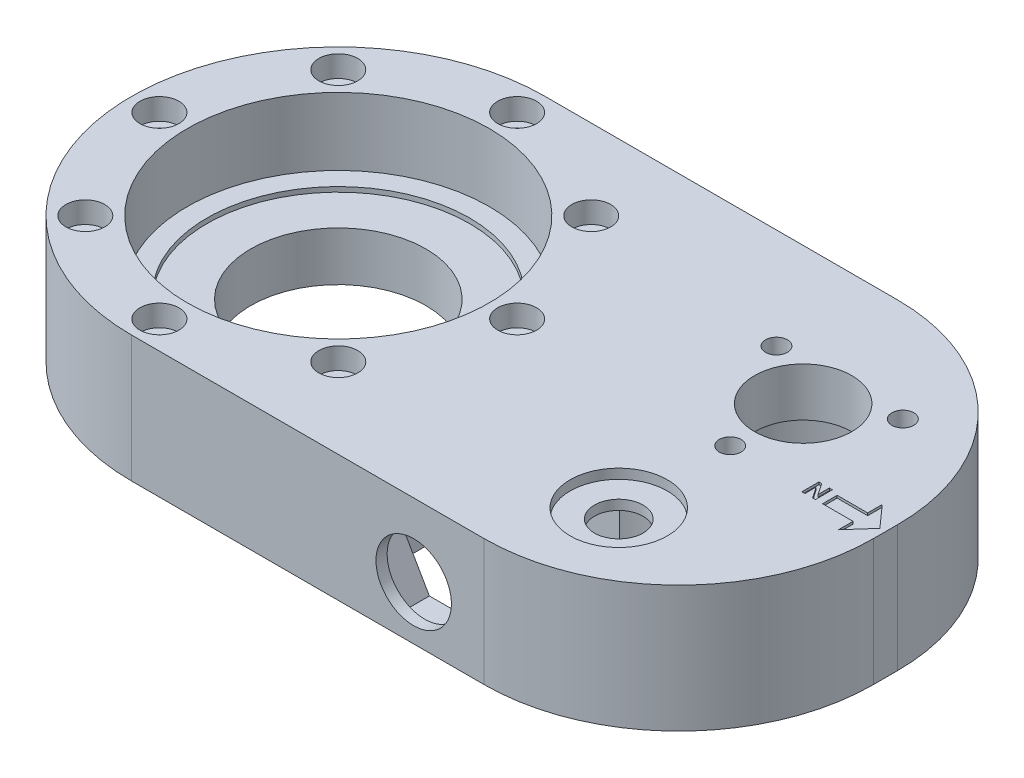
ISO-10303-21;
HEADER;
FILE_DESCRIPTION(('STEP AP214'),'2;1');
FILE_NAME('part.step','',(''),(''),'','','');
FILE_SCHEMA(('AUTOMOTIVE_DESIGN { 1 0 10303 214 1 1 1 1 }'));
ENDSEC;
DATA;
#1=APPLICATION_CONTEXT('core data for automotive mechanical design processes');
#2=APPLICATION_PROTOCOL_DEFINITION('international standard','automotive_design',2000,#1);
#3=PRODUCT_CONTEXT('',#1,'mechanical');
#4=PRODUCT('Part','Part','',(#3));
#5=PRODUCT_RELATED_PRODUCT_CATEGORY('part','',(#4));
#6=PRODUCT_DEFINITION_FORMATION('','',#4);
#7=PRODUCT_DEFINITION_CONTEXT('part definition',#1,'design');
#8=PRODUCT_DEFINITION('design','',#6,#7);
#9=PRODUCT_DEFINITION_SHAPE('','',#8);
#10=(LENGTH_UNIT() NAMED_UNIT(*) SI_UNIT(.MILLI.,.METRE.));
#11=(NAMED_UNIT(*) PLANE_ANGLE_UNIT() SI_UNIT($,.RADIAN.));
#12=(NAMED_UNIT(*) SI_UNIT($,.STERADIAN.) SOLID_ANGLE_UNIT());
#13=UNCERTAINTY_MEASURE_WITH_UNIT(LENGTH_MEASURE(1.E-05),#10,'distance_accuracy_value','');
#14=(GEOMETRIC_REPRESENTATION_CONTEXT(3) GLOBAL_UNCERTAINTY_ASSIGNED_CONTEXT((#13)) GLOBAL_UNIT_ASSIGNED_CONTEXT((#10,
#11,#12)) REPRESENTATION_CONTEXT('',''));
#15=CARTESIAN_POINT('',(0.,0.,0.));
#16=DIRECTION('',(0.,0.,1.));
#17=DIRECTION('',(1.,0.,0.));
#18=AXIS2_PLACEMENT_3D('',#15,#16,#17);
#19=CARTESIAN_POINT('',(45.8421086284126,22.,12.5007117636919));
#20=DIRECTION('',(0.,0.,-1.));
#21=DIRECTION('',(-1.,0.,0.));
#22=AXIS2_PLACEMENT_3D('',#19,#20,#21);
#23=PLANE('',#22);
#24=DIRECTION('',(0.,1.,0.));
#25=VECTOR('',#24,1.);
#26=CARTESIAN_POINT('',(52.4449173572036,-0.734495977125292,12.5007117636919));
#27=LINE('',#26,#25);
#28=CARTESIAN_POINT('',(52.4449173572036,20.625,12.5007117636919));
#29=VERTEX_POINT('',#28);
#30=CARTESIAN_POINT('',(52.4449173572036,22.,12.5007117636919));
#31=VERTEX_POINT('',#30);
#32=EDGE_CURVE('E390',#29,#31,#27,.T.);
#33=ORIENTED_EDGE('',*,*,#32,.F.);
#34=DIRECTION('',(-1.,0.,0.));
#35=VECTOR('',#34,1.);
#36=CARTESIAN_POINT('',(49.9449173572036,20.625,12.5007117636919));
#37=LINE('',#36,#35);
#38=CARTESIAN_POINT('',(49.9449173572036,20.625,12.5007117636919));
#39=VERTEX_POINT('',#38);
#40=EDGE_CURVE('E388',#29,#39,#37,.T.);
#41=ORIENTED_EDGE('',*,*,#40,.T.);
#42=DIRECTION('',(0.,1.,0.));
#43=VECTOR('',#42,1.);
#44=CARTESIAN_POINT('',(49.9449173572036,-0.734495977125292,12.5007117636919));
#45=LINE('',#44,#43);
#46=CARTESIAN_POINT('',(49.9449173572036,22.,12.5007117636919));
#47=VERTEX_POINT('',#46);
#48=EDGE_CURVE('E377',#39,#47,#45,.T.);
#49=ORIENTED_EDGE('',*,*,#48,.T.);
#50=DIRECTION('',(1.,0.,0.));
#51=VECTOR('',#50,1.);
#52=CARTESIAN_POINT('',(45.8421086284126,22.,12.5007117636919));
#53=LINE('',#52,#51);
#54=CARTESIAN_POINT('',(45.8421086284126,22.,12.5007117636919));
#55=VERTEX_POINT('',#54);
#56=EDGE_CURVE('E387',#55,#47,#53,.T.);
#57=ORIENTED_EDGE('',*,*,#56,.F.);
#58=DIRECTION('',(0.,-1.,0.));
#59=VECTOR('',#58,1.);
#60=CARTESIAN_POINT('',(45.8421086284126,22.,12.5007117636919));
#61=LINE('',#60,#59);
#62=CARTESIAN_POINT('',(45.8421086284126,0.,12.5007117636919));
#63=VERTEX_POINT('',#62);
#64=EDGE_CURVE('E824',#55,#63,#61,.T.);
#65=ORIENTED_EDGE('',*,*,#64,.T.);
#66=DIRECTION('',(1.,0.,0.));
#67=VECTOR('',#66,1.);
#68=CARTESIAN_POINT('',(45.8421086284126,0.,12.5007117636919));
#69=LINE('',#68,#67);
#70=CARTESIAN_POINT('',(49.3421086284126,0.,12.5007117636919));
#71=VERTEX_POINT('',#70);
#72=EDGE_CURVE('E448',#63,#71,#69,.T.);
#73=ORIENTED_EDGE('',*,*,#72,.T.);
#74=DIRECTION('',(0.,-1.,0.));
#75=VECTOR('',#74,1.);
#76=CARTESIAN_POINT('',(49.3421086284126,6.5,12.5007117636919));
#77=LINE('',#76,#75);
#78=CARTESIAN_POINT('',(49.3421086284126,6.5,12.5007117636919));
#79=VERTEX_POINT('',#78);
#80=EDGE_CURVE('E514',#79,#71,#77,.T.);
#81=ORIENTED_EDGE('',*,*,#80,.F.);
#82=DIRECTION('',(-1.,0.,0.));
#83=VECTOR('',#82,1.);
#84=CARTESIAN_POINT('',(55.8421086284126,6.5,12.5007117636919));
#85=LINE('',#84,#83);
#86=CARTESIAN_POINT('',(55.8421086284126,6.5,12.5007117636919));
#87=VERTEX_POINT('',#86);
#88=EDGE_CURVE('E534',#87,#79,#85,.T.);
#89=ORIENTED_EDGE('',*,*,#88,.F.);
#90=DIRECTION('',(0.,-1.,0.));
#91=VECTOR('',#90,1.);
#92=CARTESIAN_POINT('',(55.8421086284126,6.5,12.5007117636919));
#93=LINE('',#92,#91);
#94=CARTESIAN_POINT('',(55.8421086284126,0.,12.5007117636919));
#95=VERTEX_POINT('',#94);
#96=EDGE_CURVE('E517',#87,#95,#93,.T.);
#97=ORIENTED_EDGE('',*,*,#96,.T.);
#98=CARTESIAN_POINT('',(70.3098119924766,0.,12.5007117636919));
#99=VERTEX_POINT('',#98);
#100=EDGE_CURVE('E1051',#95,#99,#69,.T.);
#101=ORIENTED_EDGE('',*,*,#100,.T.);
#102=DIRECTION('',(0.,-1.,0.));
#103=VECTOR('',#102,1.);
#104=CARTESIAN_POINT('',(70.3098119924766,22.,12.5007117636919));
#105=LINE('',#104,#103);
#106=CARTESIAN_POINT('',(70.3098119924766,22.,12.5007117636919));
#107=VERTEX_POINT('',#106);
#108=EDGE_CURVE('E830',#107,#99,#105,.T.);
#109=ORIENTED_EDGE('',*,*,#108,.F.);
#110=CARTESIAN_POINT('',(66.0589100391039,22.,12.5007117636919));
#111=VERTEX_POINT('',#110);
#112=EDGE_CURVE('E400',#111,#107,#53,.T.);
#113=ORIENTED_EDGE('',*,*,#112,.F.);
#114=DIRECTION('',(0.,1.,0.));
#115=VECTOR('',#114,1.);
#116=CARTESIAN_POINT('',(66.0589100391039,-0.734495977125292,12.5007117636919));
#117=LINE('',#116,#115);
#118=CARTESIAN_POINT('',(66.0589100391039,20.625,12.5007117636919));
#119=VERTEX_POINT('',#118);
#120=EDGE_CURVE('E674',#119,#111,#117,.T.);
#121=ORIENTED_EDGE('',*,*,#120,.F.);
#122=DIRECTION('',(-1.,0.,0.));
#123=VECTOR('',#122,1.);
#124=CARTESIAN_POINT('',(63.5589100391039,20.625,12.5007117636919));
#125=LINE('',#124,#123);
#126=CARTESIAN_POINT('',(63.5589100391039,20.625,12.5007117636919));
#127=VERTEX_POINT('',#126);
#128=EDGE_CURVE('E686',#119,#127,#125,.T.);
#129=ORIENTED_EDGE('',*,*,#128,.T.);
#130=DIRECTION('',(0.,1.,0.));
#131=VECTOR('',#130,1.);
#132=CARTESIAN_POINT('',(63.5589100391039,-0.734495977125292,12.5007117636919));
#133=LINE('',#132,#131);
#134=CARTESIAN_POINT('',(63.5589100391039,22.,12.5007117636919));
#135=VERTEX_POINT('',#134);
#136=EDGE_CURVE('E671',#127,#135,#133,.T.);
#137=ORIENTED_EDGE('',*,*,#136,.T.);
#138=EDGE_CURVE('E398',#31,#135,#53,.T.);
#139=ORIENTED_EDGE('',*,*,#138,.F.);
#140=EDGE_LOOP('',(#33,#41,#49,#57,#65,#73,#81,#89,#97,#101,#109,#113,#121,#129,#137,#139));
#141=FACE_BOUND('',#140,.T.);
#142=ADVANCED_FACE('F33',(#141),#23,.F.);
#143=CARTESIAN_POINT('',(70.1617187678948,22.,33.7133982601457));
#144=DIRECTION('',(0.,0.,1.));
#145=DIRECTION('',(1.,0.,0.));
#146=AXIS2_PLACEMENT_3D('',#143,#144,#145);
#147=PLANE('',#146);
#148=DIRECTION('',(0.,1.,0.));
#149=VECTOR('',#148,1.);
#150=CARTESIAN_POINT('',(52.4449173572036,-0.734495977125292,33.7133982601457));
#151=LINE('',#150,#149);
#152=CARTESIAN_POINT('',(52.4449173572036,20.625,33.7133982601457));
#153=VERTEX_POINT('',#152);
#154=CARTESIAN_POINT('',(52.4449173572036,22.,33.7133982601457));
#155=VERTEX_POINT('',#154);
#156=EDGE_CURVE('E695',#153,#155,#151,.T.);
#157=ORIENTED_EDGE('',*,*,#156,.T.);
#158=DIRECTION('',(-1.,0.,0.));
#159=VECTOR('',#158,1.);
#160=CARTESIAN_POINT('',(70.1617187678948,22.,33.7133982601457));
#161=LINE('',#160,#159);
#162=CARTESIAN_POINT('',(63.5589100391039,22.,33.7133982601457));
#163=VERTEX_POINT('',#162);
#164=EDGE_CURVE('E444',#163,#155,#161,.T.);
#165=ORIENTED_EDGE('',*,*,#164,.F.);
#166=DIRECTION('',(0.,1.,0.));
#167=VECTOR('',#166,1.);
#168=CARTESIAN_POINT('',(63.5589100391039,-0.734495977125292,33.7133982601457));
#169=LINE('',#168,#167);
#170=CARTESIAN_POINT('',(63.5589100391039,20.625,33.7133982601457));
#171=VERTEX_POINT('',#170);
#172=EDGE_CURVE('E56',#171,#163,#169,.T.);
#173=ORIENTED_EDGE('',*,*,#172,.F.);
#174=DIRECTION('',(1.,0.,0.));
#175=VECTOR('',#174,1.);
#176=CARTESIAN_POINT('',(52.4449173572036,20.625,33.7133982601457));
#177=LINE('',#176,#175);
#178=EDGE_CURVE('E476',#153,#171,#177,.T.);
#179=ORIENTED_EDGE('',*,*,#178,.F.);
#180=EDGE_LOOP('',(#157,#165,#173,#179));
#181=FACE_BOUND('',#180,.T.);
#182=ADVANCED_FACE('F742',(#181),#147,.F.);
#183=DIRECTION('',(0.,1.,0.));
#184=VECTOR('',#183,1.);
#185=CARTESIAN_POINT('',(49.9449173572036,-0.734495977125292,33.7133982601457));
#186=LINE('',#185,#184);
#187=CARTESIAN_POINT('',(49.9449173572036,20.625,33.7133982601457));
#188=VERTEX_POINT('',#187);
#189=CARTESIAN_POINT('',(49.9449173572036,22.,33.7133982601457));
#190=VERTEX_POINT('',#189);
#191=EDGE_CURVE('E48',#188,#190,#186,.T.);
#192=ORIENTED_EDGE('',*,*,#191,.F.);
#193=DIRECTION('',(1.,0.,0.));
#194=VECTOR('',#193,1.);
#195=CARTESIAN_POINT('',(49.9449173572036,20.625,33.7133982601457));
#196=LINE('',#195,#194);
#197=EDGE_CURVE('E389',#188,#153,#196,.T.);
#198=ORIENTED_EDGE('',*,*,#197,.T.);
#199=DIRECTION('',(0.5,0.866025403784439,0.));
#200=VECTOR('',#199,1.);
#201=CARTESIAN_POINT('',(46.8879210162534,11.,33.7133982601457));
#202=LINE('',#201,#200);
#203=CARTESIAN_POINT('',(46.8879210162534,11.,33.7133982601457));
#204=VERTEX_POINT('',#203);
#205=EDGE_CURVE('E480',#204,#153,#202,.T.);
#206=ORIENTED_EDGE('',*,*,#205,.F.);
#207=DIRECTION('',(-0.499999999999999,0.866025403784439,0.));
#208=VECTOR('',#207,1.);
#209=CARTESIAN_POINT('',(52.4449173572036,1.37500000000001,33.7133982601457));
#210=LINE('',#209,#208);
#211=CARTESIAN_POINT('',(52.4449173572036,1.37500000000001,33.7133982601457));
#212=VERTEX_POINT('',#211);
#213=EDGE_CURVE('E483',#212,#204,#210,.T.);
#214=ORIENTED_EDGE('',*,*,#213,.F.);
#215=DIRECTION('',(-1.,0.,0.));
#216=VECTOR('',#215,1.);
#217=CARTESIAN_POINT('',(63.5589100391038,1.37500000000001,33.7133982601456));
#218=LINE('',#217,#216);
#219=CARTESIAN_POINT('',(63.5589100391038,1.37500000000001,33.7133982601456));
#220=VERTEX_POINT('',#219);
#221=EDGE_CURVE('E486',#220,#212,#218,.T.);
#222=ORIENTED_EDGE('',*,*,#221,.F.);
#223=DIRECTION('',(-0.500000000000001,-0.866025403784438,0.));
#224=VECTOR('',#223,1.);
#225=CARTESIAN_POINT('',(69.115906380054,11.,33.7133982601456));
#226=LINE('',#225,#224);
#227=CARTESIAN_POINT('',(69.115906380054,11.,33.7133982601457));
#228=VERTEX_POINT('',#227);
#229=EDGE_CURVE('E489',#228,#220,#226,.T.);
#230=ORIENTED_EDGE('',*,*,#229,.F.);
#231=DIRECTION('',(0.5,-0.866025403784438,0.));
#232=VECTOR('',#231,1.);
#233=CARTESIAN_POINT('',(63.5589100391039,20.625,33.7133982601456));
#234=LINE('',#233,#232);
#235=EDGE_CURVE('E492',#171,#228,#234,.T.);
#236=ORIENTED_EDGE('',*,*,#235,.F.);
#237=DIRECTION('',(1.,0.,0.));
#238=VECTOR('',#237,1.);
#239=CARTESIAN_POINT('',(63.5589100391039,20.625,33.7133982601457));
#240=LINE('',#239,#238);
#241=CARTESIAN_POINT('',(66.0589100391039,20.625,33.7133982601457));
#242=VERTEX_POINT('',#241);
#243=EDGE_CURVE('E667',#171,#242,#240,.T.);
#244=ORIENTED_EDGE('',*,*,#243,.T.);
#245=DIRECTION('',(0.,1.,0.));
#246=VECTOR('',#245,1.);
#247=CARTESIAN_POINT('',(66.0589100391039,-0.734495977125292,33.7133982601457));
#248=LINE('',#247,#246);
#249=CARTESIAN_POINT('',(66.0589100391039,22.,33.7133982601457));
#250=VERTEX_POINT('',#249);
#251=EDGE_CURVE('E676',#242,#250,#248,.T.);
#252=ORIENTED_EDGE('',*,*,#251,.T.);
#253=CARTESIAN_POINT('',(70.1617187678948,22.,33.7133982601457));
#254=VERTEX_POINT('',#253);
#255=EDGE_CURVE('E441',#254,#250,#161,.T.);
#256=ORIENTED_EDGE('',*,*,#255,.F.);
#257=DIRECTION('',(0.,-1.,0.));
#258=VECTOR('',#257,1.);
#259=CARTESIAN_POINT('',(70.1617187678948,22.,33.7133982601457));
#260=LINE('',#259,#258);
#261=CARTESIAN_POINT('',(70.1617187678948,0.,33.7133982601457));
#262=VERTEX_POINT('',#261);
#263=EDGE_CURVE('E397',#254,#262,#260,.T.);
#264=ORIENTED_EDGE('',*,*,#263,.T.);
#265=DIRECTION('',(-1.,0.,0.));
#266=VECTOR('',#265,1.);
#267=CARTESIAN_POINT('',(70.1617187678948,0.,33.7133982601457));
#268=LINE('',#267,#266);
#269=CARTESIAN_POINT('',(45.8421086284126,0.,33.7133982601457));
#270=VERTEX_POINT('',#269);
#271=EDGE_CURVE('E747',#262,#270,#268,.T.);
#272=ORIENTED_EDGE('',*,*,#271,.T.);
#273=DIRECTION('',(0.,-1.,0.));
#274=VECTOR('',#273,1.);
#275=CARTESIAN_POINT('',(45.8421086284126,22.,33.7133982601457));
#276=LINE('',#275,#274);
#277=CARTESIAN_POINT('',(45.8421086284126,22.,33.7133982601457));
#278=VERTEX_POINT('',#277);
#279=EDGE_CURVE('E402',#278,#270,#276,.T.);
#280=ORIENTED_EDGE('',*,*,#279,.F.);
#281=EDGE_CURVE('E445',#190,#278,#161,.T.);
#282=ORIENTED_EDGE('',*,*,#281,.F.);
#283=EDGE_LOOP('',(#192,#198,#206,#214,#222,#230,#236,#244,#252,#256,#264,#272,#280,#282));
#284=FACE_BOUND('',#283,.T.);
#285=ADVANCED_FACE('F724',(#284),#147,.F.);
#286=CARTESIAN_POINT('',(80.8421086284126,22.,23.1811016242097));
#287=DIRECTION('',(0.,-1.,0.));
#288=DIRECTION('',(0.,0.,-1.));
#289=AXIS2_PLACEMENT_3D('',#286,#287,#288);
#290=PLANE('',#289);
#291=ORIENTED_EDGE('',*,*,#164,.T.);
#292=DIRECTION('',(0.,0.,1.));
#293=VECTOR('',#292,1.);
#294=CARTESIAN_POINT('',(52.4449173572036,22.,33.7133982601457));
#295=LINE('',#294,#293);
#296=EDGE_CURVE('E382',#31,#155,#295,.T.);
#297=ORIENTED_EDGE('',*,*,#296,.F.);
#298=ORIENTED_EDGE('',*,*,#138,.T.);
#299=DIRECTION('',(0.,0.,-1.));
#300=VECTOR('',#299,1.);
#301=CARTESIAN_POINT('',(63.5589100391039,22.,12.5007117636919));
#302=LINE('',#301,#300);
#303=EDGE_CURVE('E682',#163,#135,#302,.T.);
#304=ORIENTED_EDGE('',*,*,#303,.F.);
#305=EDGE_LOOP('',(#291,#297,#298,#304));
#306=FACE_BOUND('',#305,.T.);
#307=ADVANCED_FACE('F712',(#306),#290,.T.);
#308=ORIENTED_EDGE('',*,*,#56,.T.);
#309=DIRECTION('',(0.,0.,-1.));
#310=VECTOR('',#309,1.);
#311=CARTESIAN_POINT('',(49.9449173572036,22.,33.7133982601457));
#312=LINE('',#311,#310);
#313=EDGE_CURVE('E374',#190,#47,#312,.T.);
#314=ORIENTED_EDGE('',*,*,#313,.F.);
#315=ORIENTED_EDGE('',*,*,#281,.T.);
#316=CARTESIAN_POINT('',(45.8421086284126,22.,32.7133982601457));
#317=DIRECTION('',(0.,-1.,0.));
#318=DIRECTION('',(0.,0.,-1.));
#319=AXIS2_PLACEMENT_3D('',#316,#317,#318);
#320=CIRCLE('',#319,1.);
#321=CARTESIAN_POINT('',(44.8421086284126,22.,32.7133982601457));
#322=VERTEX_POINT('',#321);
#323=EDGE_CURVE('E438',#278,#322,#320,.T.);
#324=ORIENTED_EDGE('',*,*,#323,.T.);
#325=DIRECTION('',(0.,0.,-1.));
#326=VECTOR('',#325,1.);
#327=CARTESIAN_POINT('',(44.8421086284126,22.,32.7133982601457));
#328=LINE('',#327,#326);
#329=CARTESIAN_POINT('',(44.8421086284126,22.,31.7133982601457));
#330=VERTEX_POINT('',#329);
#331=EDGE_CURVE('E435',#322,#330,#328,.T.);
#332=ORIENTED_EDGE('',*,*,#331,.T.);
#333=CARTESIAN_POINT('',(43.8421086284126,22.,31.7133982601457));
#334=DIRECTION('',(0.,1.,0.));
#335=DIRECTION('',(0.,0.,-1.));
#336=AXIS2_PLACEMENT_3D('',#333,#334,#335);
#337=CIRCLE('',#336,1.00000000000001);
#338=CARTESIAN_POINT('',(43.8421086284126,22.,30.7133982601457));
#339=VERTEX_POINT('',#338);
#340=EDGE_CURVE('E432',#330,#339,#337,.T.);
#341=ORIENTED_EDGE('',*,*,#340,.T.);
#342=DIRECTION('',(-1.,0.,0.));
#343=VECTOR('',#342,1.);
#344=CARTESIAN_POINT('',(43.8421086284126,22.,30.7133982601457));
#345=LINE('',#344,#343);
#346=CARTESIAN_POINT('',(42.8421086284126,22.,30.7133982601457));
#347=VERTEX_POINT('',#346);
#348=EDGE_CURVE('E429',#339,#347,#345,.T.);
#349=ORIENTED_EDGE('',*,*,#348,.T.);
#350=CARTESIAN_POINT('',(42.8421086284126,22.,29.7133982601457));
#351=DIRECTION('',(0.,-1.,0.));
#352=DIRECTION('',(0.,0.,-1.));
#353=AXIS2_PLACEMENT_3D('',#350,#351,#352);
#354=CIRCLE('',#353,1.00000000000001);
#355=CARTESIAN_POINT('',(41.8421086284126,22.,29.7133982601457));
#356=VERTEX_POINT('',#355);
#357=EDGE_CURVE('E426',#347,#356,#354,.T.);
#358=ORIENTED_EDGE('',*,*,#357,.T.);
#359=DIRECTION('',(0.,0.,-1.));
#360=VECTOR('',#359,1.);
#361=CARTESIAN_POINT('',(41.8421086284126,22.,29.7133982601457));
#362=LINE('',#361,#360);
#363=CARTESIAN_POINT('',(41.8421086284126,22.,16.5007117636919));
#364=VERTEX_POINT('',#363);
#365=EDGE_CURVE('E423',#356,#364,#362,.T.);
#366=ORIENTED_EDGE('',*,*,#365,.T.);
#367=CARTESIAN_POINT('',(42.8421086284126,22.,16.5007117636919));
#368=DIRECTION('',(0.,-1.,0.));
#369=DIRECTION('',(0.,0.,-1.));
#370=AXIS2_PLACEMENT_3D('',#367,#368,#369);
#371=CIRCLE('',#370,0.999999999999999);
#372=CARTESIAN_POINT('',(42.8421086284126,22.,15.5007117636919));
#373=VERTEX_POINT('',#372);
#374=EDGE_CURVE('E420',#364,#373,#371,.T.);
#375=ORIENTED_EDGE('',*,*,#374,.T.);
#376=DIRECTION('',(1.,0.,0.));
#377=VECTOR('',#376,1.);
#378=CARTESIAN_POINT('',(42.8421086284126,22.,15.5007117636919));
#379=LINE('',#378,#377);
#380=CARTESIAN_POINT('',(43.8421086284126,22.,15.5007117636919));
#381=VERTEX_POINT('',#380);
#382=EDGE_CURVE('E417',#373,#381,#379,.T.);
#383=ORIENTED_EDGE('',*,*,#382,.T.);
#384=CARTESIAN_POINT('',(43.8421086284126,22.,14.5007117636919));
#385=DIRECTION('',(0.,1.,0.));
#386=DIRECTION('',(0.,0.,-1.));
#387=AXIS2_PLACEMENT_3D('',#384,#385,#386);
#388=CIRCLE('',#387,1.);
#389=CARTESIAN_POINT('',(44.8421086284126,22.,14.5007117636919));
#390=VERTEX_POINT('',#389);
#391=EDGE_CURVE('E412',#381,#390,#388,.T.);
#392=ORIENTED_EDGE('',*,*,#391,.T.);
#393=DIRECTION('',(0.,0.,-1.));
#394=VECTOR('',#393,1.);
#395=CARTESIAN_POINT('',(44.8421086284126,22.,14.5007117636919));
#396=LINE('',#395,#394);
#397=CARTESIAN_POINT('',(44.8421086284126,22.,13.5007117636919));
#398=VERTEX_POINT('',#397);
#399=EDGE_CURVE('E411',#390,#398,#396,.T.);
#400=ORIENTED_EDGE('',*,*,#399,.T.);
#401=CARTESIAN_POINT('',(45.8421086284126,22.,13.5007117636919));
#402=DIRECTION('',(0.,-1.,0.));
#403=DIRECTION('',(0.,0.,1.));
#404=AXIS2_PLACEMENT_3D('',#401,#402,#403);
#405=CIRCLE('',#404,0.999999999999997);
#406=EDGE_CURVE('E396',#398,#55,#405,.T.);
#407=ORIENTED_EDGE('',*,*,#406,.T.);
#408=EDGE_LOOP('',(#308,#314,#315,#324,#332,#341,#349,#358,#366,#375,#383,#392,#400,#407));
#409=FACE_BOUND('',#408,.T.);
#410=ADVANCED_FACE('F393',(#409),#290,.T.);
#411=CARTESIAN_POINT('',(80.8421086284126,22.,23.1811016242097));
#412=DIRECTION('',(0.,-1.,0.));
#413=DIRECTION('',(0.,0.,-1.));
#414=AXIS2_PLACEMENT_3D('',#411,#412,#413);
#415=CIRCLE('',#414,5.);
#416=CARTESIAN_POINT('',(80.8421086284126,22.,18.1811016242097));
#417=VERTEX_POINT('',#416);
#418=EDGE_CURVE('E449',#417,#417,#415,.T.);
#419=ORIENTED_EDGE('',*,*,#418,.F.);
#420=EDGE_LOOP('',(#419));
#421=FACE_BOUND('',#420,.T.);
#422=ORIENTED_EDGE('',*,*,#255,.T.);
#423=DIRECTION('',(0.,0.,1.));
#424=VECTOR('',#423,1.);
#425=CARTESIAN_POINT('',(66.0589100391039,22.,12.5007117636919));
#426=LINE('',#425,#424);
#427=EDGE_CURVE('E680',#111,#250,#426,.T.);
#428=ORIENTED_EDGE('',*,*,#427,.F.);
#429=ORIENTED_EDGE('',*,*,#112,.T.);
#430=CARTESIAN_POINT('',(80.8421086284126,22.,23.1811016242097));
#431=DIRECTION('',(0.,-1.,0.));
#432=DIRECTION('',(0.,0.,-1.));
#433=AXIS2_PLACEMENT_3D('',#430,#431,#432);
#434=CIRCLE('',#433,15.);
#435=EDGE_CURVE('E446',#107,#254,#434,.T.);
#436=ORIENTED_EDGE('',*,*,#435,.T.);
#437=EDGE_LOOP('',(#422,#428,#429,#436));
#438=FACE_BOUND('',#437,.T.);
#439=ADVANCED_FACE('F1095',(#421,#438),#290,.T.);
#440=CARTESIAN_POINT('',(72.5,26.,-2.5));
#441=DIRECTION('',(0.,-1.,0.));
#442=DIRECTION('',(0.,0.,-1.));
#443=AXIS2_PLACEMENT_3D('',#440,#441,#442);
#444=PLANE('',#443);
#445=CARTESIAN_POINT('',(72.5,26.,-2.5));
#446=DIRECTION('',(0.,1.,0.));
#447=DIRECTION('',(0.,0.,-1.));
#448=AXIS2_PLACEMENT_3D('',#445,#446,#447);
#449=CIRCLE('',#448,40.);
#450=CARTESIAN_POINT('',(112.5,26.,-2.5));
#451=VERTEX_POINT('',#450);
#452=CARTESIAN_POINT('',(72.5,26.,-42.5));
#453=VERTEX_POINT('',#452);
#454=EDGE_CURVE('E983',#451,#453,#449,.T.);
#455=ORIENTED_EDGE('',*,*,#454,.T.);
#456=DIRECTION('',(-1.,0.,0.));
#457=VECTOR('',#456,1.);
#458=CARTESIAN_POINT('',(72.5,26.,-42.5));
#459=LINE('',#458,#457);
#460=CARTESIAN_POINT('',(0.,26.,-42.5));
#461=VERTEX_POINT('',#460);
#462=EDGE_CURVE('E986',#453,#461,#459,.T.);
#463=ORIENTED_EDGE('',*,*,#462,.T.);
#464=CARTESIAN_POINT('',(0.,26.,0.));
#465=DIRECTION('',(0.,1.,0.));
#466=DIRECTION('',(0.,0.,1.));
#467=AXIS2_PLACEMENT_3D('',#464,#465,#466);
#468=CIRCLE('',#467,42.5);
#469=CARTESIAN_POINT('',(0.,26.,42.5));
#470=VERTEX_POINT('',#469);
#471=EDGE_CURVE('E989',#461,#470,#468,.T.);
#472=ORIENTED_EDGE('',*,*,#471,.T.);
#473=DIRECTION('',(1.,0.,0.));
#474=VECTOR('',#473,1.);
#475=CARTESIAN_POINT('',(0.,26.,42.5));
#476=LINE('',#475,#474);
#477=CARTESIAN_POINT('',(72.5,26.,42.5));
#478=VERTEX_POINT('',#477);
#479=EDGE_CURVE('E991',#470,#478,#476,.T.);
#480=ORIENTED_EDGE('',*,*,#479,.T.);
#481=CARTESIAN_POINT('',(72.5,26.,2.5));
#482=DIRECTION('',(0.,1.,0.));
#483=DIRECTION('',(0.,0.,-1.));
#484=AXIS2_PLACEMENT_3D('',#481,#482,#483);
#485=CIRCLE('',#484,40.);
#486=CARTESIAN_POINT('',(112.5,26.,2.5));
#487=VERTEX_POINT('',#486);
#488=EDGE_CURVE('E993',#478,#487,#485,.T.);
#489=ORIENTED_EDGE('',*,*,#488,.T.);
#490=DIRECTION('',(0.,0.,-1.));
#491=VECTOR('',#490,1.);
#492=CARTESIAN_POINT('',(112.5,26.,2.5));
#493=LINE('',#492,#491);
#494=EDGE_CURVE('E995',#487,#451,#493,.T.);
#495=ORIENTED_EDGE('',*,*,#494,.T.);
#496=EDGE_LOOP('',(#455,#463,#472,#480,#489,#495));
#497=FACE_BOUND('',#496,.T.);
#498=CARTESIAN_POINT('',(0.,26.,0.));
#499=DIRECTION('',(0.,1.,0.));
#500=DIRECTION('',(0.,0.,1.));
#501=AXIS2_PLACEMENT_3D('',#498,#499,#500);
#502=CIRCLE('',#501,31.05);
#503=CARTESIAN_POINT('',(0.,26.,31.05));
#504=VERTEX_POINT('',#503);
#505=EDGE_CURVE('E974',#504,#504,#502,.T.);
#506=ORIENTED_EDGE('',*,*,#505,.F.);
#507=EDGE_LOOP('',(#506));
#508=FACE_BOUND('',#507,.T.);
#509=CARTESIAN_POINT('',(-26.0038518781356,26.,26.003851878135));
#510=DIRECTION('',(0.,1.,0.));
#511=DIRECTION('',(0.,0.,1.));
#512=AXIS2_PLACEMENT_3D('',#509,#510,#511);
#513=CIRCLE('',#512,3.99999999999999);
#514=CARTESIAN_POINT('',(-26.0038518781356,26.,30.003851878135));
#515=VERTEX_POINT('',#514);
#516=EDGE_CURVE('E951',#515,#515,#513,.T.);
#517=ORIENTED_EDGE('',*,*,#516,.F.);
#518=EDGE_LOOP('',(#517));
#519=FACE_BOUND('',#518,.T.);
#520=CARTESIAN_POINT('',(-3.85197678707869E-13,26.,36.775));
#521=DIRECTION('',(0.,1.,0.));
#522=DIRECTION('',(0.,0.,1.));
#523=AXIS2_PLACEMENT_3D('',#520,#521,#522);
#524=CIRCLE('',#523,3.99999999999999);
#525=CARTESIAN_POINT('',(-3.85197678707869E-13,26.,40.775));
#526=VERTEX_POINT('',#525);
#527=EDGE_CURVE('E939',#526,#526,#524,.T.);
#528=ORIENTED_EDGE('',*,*,#527,.F.);
#529=EDGE_LOOP('',(#528));
#530=FACE_BOUND('',#529,.T.);
#531=CARTESIAN_POINT('',(26.0038518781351,26.,26.0038518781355));
#532=DIRECTION('',(0.,1.,0.));
#533=DIRECTION('',(0.,0.,1.));
#534=AXIS2_PLACEMENT_3D('',#531,#532,#533);
#535=CIRCLE('',#534,3.99999999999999);
#536=CARTESIAN_POINT('',(26.0038518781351,26.,30.0038518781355));
#537=VERTEX_POINT('',#536);
#538=EDGE_CURVE('E927',#537,#537,#535,.T.);
#539=ORIENTED_EDGE('',*,*,#538,.F.);
#540=EDGE_LOOP('',(#539));
#541=FACE_BOUND('',#540,.T.);
#542=CARTESIAN_POINT('',(36.775,26.,2.56798452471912E-13));
#543=DIRECTION('',(0.,1.,0.));
#544=DIRECTION('',(0.,0.,1.));
#545=AXIS2_PLACEMENT_3D('',#542,#543,#544);
#546=CIRCLE('',#545,3.99999999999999);
#547=CARTESIAN_POINT('',(36.775,26.,4.00000000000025));
#548=VERTEX_POINT('',#547);
#549=EDGE_CURVE('E915',#548,#548,#546,.T.);
#550=ORIENTED_EDGE('',*,*,#549,.F.);
#551=EDGE_LOOP('',(#550));
#552=FACE_BOUND('',#551,.T.);
#553=CARTESIAN_POINT('',(26.0038518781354,26.,-26.0038518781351));
#554=DIRECTION('',(0.,1.,0.));
#555=DIRECTION('',(0.,0.,1.));
#556=AXIS2_PLACEMENT_3D('',#553,#554,#555);
#557=CIRCLE('',#556,3.99999999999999);
#558=CARTESIAN_POINT('',(26.0038518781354,26.,-22.0038518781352));
#559=VERTEX_POINT('',#558);
#560=EDGE_CURVE('E903',#559,#559,#557,.T.);
#561=ORIENTED_EDGE('',*,*,#560,.F.);
#562=EDGE_LOOP('',(#561));
#563=FACE_BOUND('',#562,.T.);
#564=CARTESIAN_POINT('',(1.28399226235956E-13,26.,-36.775));
#565=DIRECTION('',(0.,1.,0.));
#566=DIRECTION('',(0.,0.,1.));
#567=AXIS2_PLACEMENT_3D('',#564,#565,#566);
#568=CIRCLE('',#567,3.99999999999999);
#569=CARTESIAN_POINT('',(1.28399226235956E-13,26.,-32.775));
#570=VERTEX_POINT('',#569);
#571=EDGE_CURVE('E891',#570,#570,#568,.T.);
#572=ORIENTED_EDGE('',*,*,#571,.F.);
#573=EDGE_LOOP('',(#572));
#574=FACE_BOUND('',#573,.T.);
#575=CARTESIAN_POINT('',(-26.0038518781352,26.,-26.0038518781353));
#576=DIRECTION('',(0.,1.,0.));
#577=DIRECTION('',(0.,0.,1.));
#578=AXIS2_PLACEMENT_3D('',#575,#576,#577);
#579=CIRCLE('',#578,3.99999999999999);
#580=CARTESIAN_POINT('',(-26.0038518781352,26.,-22.0038518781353));
#581=VERTEX_POINT('',#580);
#582=EDGE_CURVE('E879',#581,#581,#579,.T.);
#583=ORIENTED_EDGE('',*,*,#582,.F.);
#584=EDGE_LOOP('',(#583));
#585=FACE_BOUND('',#584,.T.);
#586=CARTESIAN_POINT('',(-36.775,26.,0.));
#587=DIRECTION('',(0.,1.,0.));
#588=DIRECTION('',(0.,0.,1.));
#589=AXIS2_PLACEMENT_3D('',#586,#587,#588);
#590=CIRCLE('',#589,3.99999999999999);
#591=CARTESIAN_POINT('',(-36.775,26.,3.99999999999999));
#592=VERTEX_POINT('',#591);
#593=EDGE_CURVE('E864',#592,#592,#590,.T.);
#594=ORIENTED_EDGE('',*,*,#593,.F.);
#595=EDGE_LOOP('',(#594));
#596=FACE_BOUND('',#595,.T.);
#597=CARTESIAN_POINT('',(81.2466396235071,26.,-14.3259746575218));
#598=DIRECTION('',(0.,-1.,0.));
#599=DIRECTION('',(0.,0.,-1.));
#600=AXIS2_PLACEMENT_3D('',#597,#598,#599);
#601=CIRCLE('',#600,9.99999999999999);
#602=CARTESIAN_POINT('',(81.2466396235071,26.,-24.3259746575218));
#603=VERTEX_POINT('',#602);
#604=EDGE_CURVE('E860',#603,#603,#601,.T.);
#605=ORIENTED_EDGE('',*,*,#604,.T.);
#606=EDGE_LOOP('',(#605));
#607=FACE_BOUND('',#606,.T.);
#608=CARTESIAN_POINT('',(68.2562585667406,26.,-21.8259746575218));
#609=DIRECTION('',(0.,-1.,0.));
#610=DIRECTION('',(0.,0.,-1.));
#611=AXIS2_PLACEMENT_3D('',#608,#609,#610);
#612=CIRCLE('',#611,2.25);
#613=CARTESIAN_POINT('',(68.2562585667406,26.,-24.0759746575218));
#614=VERTEX_POINT('',#613);
#615=EDGE_CURVE('E854',#614,#614,#612,.T.);
#616=ORIENTED_EDGE('',*,*,#615,.T.);
#617=EDGE_LOOP('',(#616));
#618=FACE_BOUND('',#617,.T.);
#619=CARTESIAN_POINT('',(94.2370206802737,26.,-21.8259746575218));
#620=DIRECTION('',(0.,-1.,0.));
#621=DIRECTION('',(0.,0.,-1.));
#622=AXIS2_PLACEMENT_3D('',#619,#620,#621);
#623=CIRCLE('',#622,2.25);
#624=CARTESIAN_POINT('',(94.2370206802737,26.,-24.0759746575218));
#625=VERTEX_POINT('',#624);
#626=EDGE_CURVE('E848',#625,#625,#623,.T.);
#627=ORIENTED_EDGE('',*,*,#626,.T.);
#628=EDGE_LOOP('',(#627));
#629=FACE_BOUND('',#628,.T.);
#630=CARTESIAN_POINT('',(81.2466396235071,26.,0.674025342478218));
#631=DIRECTION('',(0.,-1.,0.));
#632=DIRECTION('',(0.,0.,-1.));
#633=AXIS2_PLACEMENT_3D('',#630,#631,#632);
#634=CIRCLE('',#633,2.25);
#635=CARTESIAN_POINT('',(81.2466396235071,26.,-1.57597465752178));
#636=VERTEX_POINT('',#635);
#637=EDGE_CURVE('E842',#636,#636,#634,.T.);
#638=ORIENTED_EDGE('',*,*,#637,.T.);
#639=EDGE_LOOP('',(#638));
#640=FACE_BOUND('',#639,.T.);
#641=CARTESIAN_POINT('',(80.8421086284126,26.,23.1811016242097));
#642=DIRECTION('',(0.,1.,0.));
#643=DIRECTION('',(0.,0.,1.));
#644=AXIS2_PLACEMENT_3D('',#641,#642,#643);
#645=CIRCLE('',#644,9.99999999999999);
#646=CARTESIAN_POINT('',(80.8421086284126,26.,33.1811016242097));
#647=VERTEX_POINT('',#646);
#648=EDGE_CURVE('E454',#647,#647,#645,.T.);
#649=ORIENTED_EDGE('',*,*,#648,.F.);
#650=EDGE_LOOP('',(#649));
#651=FACE_BOUND('',#650,.T.);
#652=DIRECTION('',(-1.,0.,0.));
#653=VECTOR('',#652,1.);
#654=CARTESIAN_POINT('',(101.066843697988,26.,-1.5));
#655=LINE('',#654,#653);
#656=CARTESIAN_POINT('',(107.338029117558,26.,-1.5));
#657=VERTEX_POINT('',#656);
#658=CARTESIAN_POINT('',(101.066843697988,26.,-1.5));
#659=VERTEX_POINT('',#658);
#660=EDGE_CURVE('E571',#657,#659,#655,.T.);
#661=ORIENTED_EDGE('',*,*,#660,.F.);
#662=DIRECTION('',(0.,0.,1.));
#663=VECTOR('',#662,1.);
#664=CARTESIAN_POINT('',(107.338029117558,26.,-1.5));
#665=LINE('',#664,#663);
#666=CARTESIAN_POINT('',(107.338029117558,26.,-4.5));
#667=VERTEX_POINT('',#666);
#668=EDGE_CURVE('E574',#667,#657,#665,.T.);
#669=ORIENTED_EDGE('',*,*,#668,.F.);
#670=DIRECTION('',(-0.664411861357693,0.,-0.747366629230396));
#671=VECTOR('',#670,1.);
#672=CARTESIAN_POINT('',(107.338029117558,26.,-4.5));
#673=LINE('',#672,#671);
#674=CARTESIAN_POINT('',(111.33854674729,26.,0.));
#675=VERTEX_POINT('',#674);
#676=EDGE_CURVE('E555',#675,#667,#673,.T.);
#677=ORIENTED_EDGE('',*,*,#676,.F.);
#678=DIRECTION('',(0.664411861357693,0.,-0.747366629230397));
#679=VECTOR('',#678,1.);
#680=CARTESIAN_POINT('',(111.33854674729,26.,0.));
#681=LINE('',#680,#679);
#682=CARTESIAN_POINT('',(107.338029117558,26.,4.5));
#683=VERTEX_POINT('',#682);
#684=EDGE_CURVE('E559',#683,#675,#681,.T.);
#685=ORIENTED_EDGE('',*,*,#684,.F.);
#686=DIRECTION('',(0.,0.,1.));
#687=VECTOR('',#686,1.);
#688=CARTESIAN_POINT('',(107.338029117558,26.,4.5));
#689=LINE('',#688,#687);
#690=CARTESIAN_POINT('',(107.338029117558,26.,1.5));
#691=VERTEX_POINT('',#690);
#692=EDGE_CURVE('E562',#691,#683,#689,.T.);
#693=ORIENTED_EDGE('',*,*,#692,.F.);
#694=DIRECTION('',(1.,0.,0.));
#695=VECTOR('',#694,1.);
#696=CARTESIAN_POINT('',(107.338029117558,26.,1.5));
#697=LINE('',#696,#695);
#698=CARTESIAN_POINT('',(101.066843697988,26.,1.5));
#699=VERTEX_POINT('',#698);
#700=EDGE_CURVE('E565',#699,#691,#697,.T.);
#701=ORIENTED_EDGE('',*,*,#700,.F.);
#702=DIRECTION('',(0.,0.,1.));
#703=VECTOR('',#702,1.);
#704=CARTESIAN_POINT('',(101.066843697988,26.,-1.5));
#705=LINE('',#704,#703);
#706=EDGE_CURVE('E568',#659,#699,#705,.T.);
#707=ORIENTED_EDGE('',*,*,#706,.F.);
#708=EDGE_LOOP('',(#661,#669,#677,#685,#693,#701,#707));
#709=FACE_BOUND('',#708,.T.);
#710=DIRECTION('',(0.,0.,-1.));
#711=VECTOR('',#710,1.);
#712=CARTESIAN_POINT('',(96.8106343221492,26.,1.5));
#713=LINE('',#712,#711);
#714=CARTESIAN_POINT('',(96.8106343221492,26.,1.5));
#715=VERTEX_POINT('',#714);
#716=CARTESIAN_POINT('',(96.8106343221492,26.,-2.));
#717=VERTEX_POINT('',#716);
#718=EDGE_CURVE('E554',#715,#717,#713,.T.);
#719=ORIENTED_EDGE('',*,*,#718,.T.);
#720=DIRECTION('',(1.,0.,0.));
#721=VECTOR('',#720,1.);
#722=CARTESIAN_POINT('',(96.8106343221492,26.,-2.));
#723=LINE('',#722,#721);
#724=CARTESIAN_POINT('',(97.3764396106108,26.,-2.));
#725=VERTEX_POINT('',#724);
#726=EDGE_CURVE('E643',#717,#725,#723,.T.);
#727=ORIENTED_EDGE('',*,*,#726,.T.);
#728=DIRECTION('',(0.567645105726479,0.,0.823273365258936));
#729=VECTOR('',#728,1.);
#730=CARTESIAN_POINT('',(97.3764396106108,26.,-2.));
#731=LINE('',#730,#729);
#732=CARTESIAN_POINT('',(98.9644804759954,26.,0.303185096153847));
#733=VERTEX_POINT('',#732);
#734=EDGE_CURVE('E640',#725,#733,#731,.T.);
#735=ORIENTED_EDGE('',*,*,#734,.T.);
#736=DIRECTION('',(0.,0.,-1.));
#737=VECTOR('',#736,1.);
#738=CARTESIAN_POINT('',(98.9644804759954,26.,0.303185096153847));
#739=LINE('',#738,#737);
#740=CARTESIAN_POINT('',(98.9644804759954,26.,-2.));
#741=VERTEX_POINT('',#740);
#742=EDGE_CURVE('E637',#733,#741,#739,.T.);
#743=ORIENTED_EDGE('',*,*,#742,.T.);
#744=DIRECTION('',(1.,0.,0.));
#745=VECTOR('',#744,1.);
#746=CARTESIAN_POINT('',(98.9644804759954,26.,-2.));
#747=LINE('',#746,#745);
#748=CARTESIAN_POINT('',(99.5926856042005,26.,-2.));
#749=VERTEX_POINT('',#748);
#750=EDGE_CURVE('E634',#741,#749,#747,.T.);
#751=ORIENTED_EDGE('',*,*,#750,.T.);
#752=DIRECTION('',(0.,0.,1.));
#753=VECTOR('',#752,1.);
#754=CARTESIAN_POINT('',(99.5926856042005,26.,-2.));
#755=LINE('',#754,#753);
#756=CARTESIAN_POINT('',(99.5926856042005,26.,1.5));
#757=VERTEX_POINT('',#756);
#758=EDGE_CURVE('E631',#749,#757,#755,.T.);
#759=ORIENTED_EDGE('',*,*,#758,.T.);
#760=DIRECTION('',(-1.,0.,0.));
#761=VECTOR('',#760,1.);
#762=CARTESIAN_POINT('',(99.5926856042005,26.,1.5));
#763=LINE('',#762,#761);
#764=CARTESIAN_POINT('',(99.0226735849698,26.,1.5));
#765=VERTEX_POINT('',#764);
#766=EDGE_CURVE('E628',#757,#765,#763,.T.);
#767=ORIENTED_EDGE('',*,*,#766,.T.);
#768=DIRECTION('',(-0.567797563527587,0.,-0.823168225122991));
#769=VECTOR('',#768,1.);
#770=CARTESIAN_POINT('',(99.0226735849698,26.,1.5));
#771=LINE('',#770,#769);
#772=CARTESIAN_POINT('',(97.4388394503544,26.,-0.796173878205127));
#773=VERTEX_POINT('',#772);
#774=EDGE_CURVE('E625',#765,#773,#771,.T.);
#775=ORIENTED_EDGE('',*,*,#774,.T.);
#776=DIRECTION('',(0.,0.,1.));
#777=VECTOR('',#776,1.);
#778=CARTESIAN_POINT('',(97.4388394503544,26.,-0.796173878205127));
#779=LINE('',#778,#777);
#780=CARTESIAN_POINT('',(97.4388394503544,26.,1.5));
#781=VERTEX_POINT('',#780);
#782=EDGE_CURVE('E622',#773,#781,#779,.T.);
#783=ORIENTED_EDGE('',*,*,#782,.T.);
#784=DIRECTION('',(-1.,0.,0.));
#785=VECTOR('',#784,1.);
#786=CARTESIAN_POINT('',(97.4388394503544,26.,1.5));
#787=LINE('',#786,#785);
#788=EDGE_CURVE('E618',#781,#715,#787,.T.);
#789=ORIENTED_EDGE('',*,*,#788,.T.);
#790=EDGE_LOOP('',(#719,#727,#735,#743,#751,#759,#767,#775,#783,#789));
#791=FACE_BOUND('',#790,.T.);
#792=ADVANCED_FACE('F1272',(#497,#508,#519,#530,#541,#552,#563,#574,#585,#596,#607,#618,#629,
#640,#651,#709,#791),#444,.F.);
#793=CARTESIAN_POINT('',(55.8421086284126,0.,9.00071176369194));
#794=DIRECTION('',(1.,0.,0.));
#795=DIRECTION('',(0.,0.,-1.));
#796=AXIS2_PLACEMENT_3D('',#793,#794,#795);
#797=CYLINDRICAL_SURFACE('',#796,6.5);
#798=DIRECTION('',(1.,0.,0.));
#799=VECTOR('',#798,1.);
#800=CARTESIAN_POINT('',(55.8421086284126,0.,2.50071176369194));
#801=LINE('',#800,#799);
#802=CARTESIAN_POINT('',(49.3421086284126,0.,2.50071176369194));
#803=VERTEX_POINT('',#802);
#804=CARTESIAN_POINT('',(55.8421086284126,0.,2.50071176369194));
#805=VERTEX_POINT('',#804);
#806=EDGE_CURVE('E522',#803,#805,#801,.T.);
#807=ORIENTED_EDGE('',*,*,#806,.T.);
#808=CARTESIAN_POINT('',(55.8421086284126,0.,9.00071176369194));
#809=DIRECTION('',(1.,0.,0.));
#810=DIRECTION('',(0.,0.,-1.));
#811=AXIS2_PLACEMENT_3D('',#808,#809,#810);
#812=CIRCLE('',#811,6.5);
#813=CARTESIAN_POINT('',(55.8421086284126,6.5,9.00071176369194));
#814=VERTEX_POINT('',#813);
#815=EDGE_CURVE('E41',#814,#805,#812,.F.);
#816=ORIENTED_EDGE('',*,*,#815,.F.);
#817=DIRECTION('',(-1.,0.,0.));
#818=VECTOR('',#817,1.);
#819=CARTESIAN_POINT('',(55.8421086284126,6.5,9.00071176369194));
#820=LINE('',#819,#818);
#821=CARTESIAN_POINT('',(49.3421086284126,6.5,9.00071176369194));
#822=VERTEX_POINT('',#821);
#823=EDGE_CURVE('E1027',#822,#814,#820,.F.);
#824=ORIENTED_EDGE('',*,*,#823,.F.);
#825=CARTESIAN_POINT('',(49.3421086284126,0.,9.00071176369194));
#826=DIRECTION('',(-1.,0.,0.));
#827=DIRECTION('',(0.,0.,1.));
#828=AXIS2_PLACEMENT_3D('',#825,#826,#827);
#829=CIRCLE('',#828,6.5);
#830=EDGE_CURVE('E11',#803,#822,#829,.F.);
#831=ORIENTED_EDGE('',*,*,#830,.F.);
#832=EDGE_LOOP('',(#807,#816,#824,#831));
#833=FACE_BOUND('',#832,.T.);
#834=ADVANCED_FACE('F35',(#833),#797,.F.);
#835=CARTESIAN_POINT('',(80.8421086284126,26.,23.1811016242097));
#836=DIRECTION('',(0.,-1.,0.));
#837=DIRECTION('',(0.,0.,-1.));
#838=AXIS2_PLACEMENT_3D('',#835,#836,#837);
#839=CYLINDRICAL_SURFACE('',#838,5.);
#840=ORIENTED_EDGE('',*,*,#418,.T.);
#841=EDGE_LOOP('',(#840));
#842=FACE_BOUND('',#841,.T.);
#843=CARTESIAN_POINT('',(80.8421086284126,24.,23.1811016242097));
#844=DIRECTION('',(0.,1.,0.));
#845=DIRECTION('',(0.,0.,1.));
#846=AXIS2_PLACEMENT_3D('',#843,#844,#845);
#847=CIRCLE('',#846,5.);
#848=CARTESIAN_POINT('',(80.8421086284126,24.,28.1811016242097));
#849=VERTEX_POINT('',#848);
#850=EDGE_CURVE('E453',#849,#849,#847,.F.);
#851=ORIENTED_EDGE('',*,*,#850,.F.);
#852=EDGE_LOOP('',(#851));
#853=FACE_BOUND('',#852,.T.);
#854=ADVANCED_FACE('F1278',(#842,#853),#839,.F.);
#855=CARTESIAN_POINT('',(72.5,0.,-2.5));
#856=DIRECTION('',(0.,-1.,0.));
#857=DIRECTION('',(0.,0.,-1.));
#858=AXIS2_PLACEMENT_3D('',#855,#856,#857);
#859=PLANE('',#858);
#860=DIRECTION('',(0.,0.,1.));
#861=VECTOR('',#860,1.);
#862=CARTESIAN_POINT('',(55.8421086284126,0.,12.5007117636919));
#863=LINE('',#862,#861);
#864=EDGE_CURVE('E529',#805,#95,#863,.T.);
#865=ORIENTED_EDGE('',*,*,#864,.F.);
#866=ORIENTED_EDGE('',*,*,#806,.F.);
#867=DIRECTION('',(0.,0.,-1.));
#868=VECTOR('',#867,1.);
#869=CARTESIAN_POINT('',(49.3421086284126,0.,12.5007117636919));
#870=LINE('',#869,#868);
#871=EDGE_CURVE('E526',#71,#803,#870,.T.);
#872=ORIENTED_EDGE('',*,*,#871,.F.);
#873=ORIENTED_EDGE('',*,*,#72,.F.);
#874=CARTESIAN_POINT('',(45.8421086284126,0.,13.5007117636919));
#875=DIRECTION('',(0.,-1.,0.));
#876=DIRECTION('',(0.,0.,1.));
#877=AXIS2_PLACEMENT_3D('',#874,#875,#876);
#878=CIRCLE('',#877,0.999999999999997);
#879=CARTESIAN_POINT('',(44.8421086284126,0.,13.5007117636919));
#880=VERTEX_POINT('',#879);
#881=EDGE_CURVE('E827',#880,#63,#878,.T.);
#882=ORIENTED_EDGE('',*,*,#881,.F.);
#883=DIRECTION('',(0.,0.,-1.));
#884=VECTOR('',#883,1.);
#885=CARTESIAN_POINT('',(44.8421086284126,0.,14.5007117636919));
#886=LINE('',#885,#884);
#887=CARTESIAN_POINT('',(44.8421086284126,0.,14.5007117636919));
#888=VERTEX_POINT('',#887);
#889=EDGE_CURVE('E820',#888,#880,#886,.T.);
#890=ORIENTED_EDGE('',*,*,#889,.F.);
#891=CARTESIAN_POINT('',(43.8421086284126,0.,14.5007117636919));
#892=DIRECTION('',(0.,1.,0.));
#893=DIRECTION('',(0.,0.,-1.));
#894=AXIS2_PLACEMENT_3D('',#891,#892,#893);
#895=CIRCLE('',#894,1.);
#896=CARTESIAN_POINT('',(43.8421086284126,0.,15.5007117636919));
#897=VERTEX_POINT('',#896);
#898=EDGE_CURVE('E813',#897,#888,#895,.T.);
#899=ORIENTED_EDGE('',*,*,#898,.F.);
#900=DIRECTION('',(1.,0.,0.));
#901=VECTOR('',#900,1.);
#902=CARTESIAN_POINT('',(42.8421086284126,0.,15.5007117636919));
#903=LINE('',#902,#901);
#904=CARTESIAN_POINT('',(42.8421086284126,0.,15.5007117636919));
#905=VERTEX_POINT('',#904);
#906=EDGE_CURVE('E1056',#905,#897,#903,.T.);
#907=ORIENTED_EDGE('',*,*,#906,.F.);
#908=CARTESIAN_POINT('',(42.8421086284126,0.,16.5007117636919));
#909=DIRECTION('',(0.,-1.,0.));
#910=DIRECTION('',(0.,0.,-1.));
#911=AXIS2_PLACEMENT_3D('',#908,#909,#910);
#912=CIRCLE('',#911,0.999999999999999);
#913=CARTESIAN_POINT('',(41.8421086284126,0.,16.5007117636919));
#914=VERTEX_POINT('',#913);
#915=EDGE_CURVE('E799',#914,#905,#912,.T.);
#916=ORIENTED_EDGE('',*,*,#915,.F.);
#917=DIRECTION('',(0.,0.,-1.));
#918=VECTOR('',#917,1.);
#919=CARTESIAN_POINT('',(41.8421086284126,0.,29.7133982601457));
#920=LINE('',#919,#918);
#921=CARTESIAN_POINT('',(41.8421086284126,0.,29.7133982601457));
#922=VERTEX_POINT('',#921);
#923=EDGE_CURVE('E791',#922,#914,#920,.T.);
#924=ORIENTED_EDGE('',*,*,#923,.F.);
#925=CARTESIAN_POINT('',(42.8421086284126,0.,29.7133982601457));
#926=DIRECTION('',(0.,-1.,0.));
#927=DIRECTION('',(0.,0.,-1.));
#928=AXIS2_PLACEMENT_3D('',#925,#926,#927);
#929=CIRCLE('',#928,1.00000000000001);
#930=CARTESIAN_POINT('',(42.8421086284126,0.,30.7133982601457));
#931=VERTEX_POINT('',#930);
#932=EDGE_CURVE('E1060',#931,#922,#929,.T.);
#933=ORIENTED_EDGE('',*,*,#932,.F.);
#934=DIRECTION('',(-1.,0.,0.));
#935=VECTOR('',#934,1.);
#936=CARTESIAN_POINT('',(43.8421086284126,0.,30.7133982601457));
#937=LINE('',#936,#935);
#938=CARTESIAN_POINT('',(43.8421086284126,0.,30.7133982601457));
#939=VERTEX_POINT('',#938);
#940=EDGE_CURVE('E777',#939,#931,#937,.T.);
#941=ORIENTED_EDGE('',*,*,#940,.F.);
#942=CARTESIAN_POINT('',(43.8421086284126,0.,31.7133982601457));
#943=DIRECTION('',(0.,1.,0.));
#944=DIRECTION('',(0.,0.,-1.));
#945=AXIS2_PLACEMENT_3D('',#942,#943,#944);
#946=CIRCLE('',#945,1.00000000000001);
#947=CARTESIAN_POINT('',(44.8421086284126,0.,31.7133982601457));
#948=VERTEX_POINT('',#947);
#949=EDGE_CURVE('E769',#948,#939,#946,.T.);
#950=ORIENTED_EDGE('',*,*,#949,.F.);
#951=DIRECTION('',(0.,0.,-1.));
#952=VECTOR('',#951,1.);
#953=CARTESIAN_POINT('',(44.8421086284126,0.,32.7133982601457));
#954=LINE('',#953,#952);
#955=CARTESIAN_POINT('',(44.8421086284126,0.,32.7133982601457));
#956=VERTEX_POINT('',#955);
#957=EDGE_CURVE('E1064',#956,#948,#954,.T.);
#958=ORIENTED_EDGE('',*,*,#957,.F.);
#959=CARTESIAN_POINT('',(45.8421086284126,0.,32.7133982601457));
#960=DIRECTION('',(0.,-1.,0.));
#961=DIRECTION('',(0.,0.,-1.));
#962=AXIS2_PLACEMENT_3D('',#959,#960,#961);
#963=CIRCLE('',#962,1.);
#964=EDGE_CURVE('E755',#270,#956,#963,.T.);
#965=ORIENTED_EDGE('',*,*,#964,.F.);
#966=ORIENTED_EDGE('',*,*,#271,.F.);
#967=CARTESIAN_POINT('',(80.8421086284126,0.,23.1811016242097));
#968=DIRECTION('',(0.,-1.,0.));
#969=DIRECTION('',(0.,0.,-1.));
#970=AXIS2_PLACEMENT_3D('',#967,#968,#969);
#971=CIRCLE('',#970,15.);
#972=EDGE_CURVE('E452',#99,#262,#971,.T.);
#973=ORIENTED_EDGE('',*,*,#972,.F.);
#974=ORIENTED_EDGE('',*,*,#100,.F.);
#975=EDGE_LOOP('',(#865,#866,#872,#873,#882,#890,#899,#907,#916,#924,#933,#941,#950,#958,#965,
#966,#973,#974));
#976=FACE_BOUND('',#975,.T.);
#977=CARTESIAN_POINT('',(81.2466396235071,0.,-14.3259746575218));
#978=DIRECTION('',(0.,-1.,0.));
#979=DIRECTION('',(0.,0.,-1.));
#980=AXIS2_PLACEMENT_3D('',#977,#978,#979);
#981=CIRCLE('',#980,20.5);
#982=CARTESIAN_POINT('',(81.2466396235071,0.,-34.8259746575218));
#983=VERTEX_POINT('',#982);
#984=EDGE_CURVE('E865',#983,#983,#981,.T.);
#985=ORIENTED_EDGE('',*,*,#984,.F.);
#986=EDGE_LOOP('',(#985));
#987=FACE_BOUND('',#986,.T.);
#988=CARTESIAN_POINT('',(-36.775,0.,0.));
#989=DIRECTION('',(0.,1.,0.));
#990=DIRECTION('',(0.,0.,1.));
#991=AXIS2_PLACEMENT_3D('',#988,#989,#990);
#992=CIRCLE('',#991,2.25);
#993=CARTESIAN_POINT('',(-36.775,0.,2.25));
#994=VERTEX_POINT('',#993);
#995=EDGE_CURVE('E876',#994,#994,#992,.T.);
#996=ORIENTED_EDGE('',*,*,#995,.T.);
#997=EDGE_LOOP('',(#996));
#998=FACE_BOUND('',#997,.T.);
#999=CARTESIAN_POINT('',(-26.0038518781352,0.,-26.0038518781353));
#1000=DIRECTION('',(0.,1.,0.));
#1001=DIRECTION('',(0.,0.,1.));
#1002=AXIS2_PLACEMENT_3D('',#999,#1000,#1001);
#1003=CIRCLE('',#1002,2.25);
#1004=CARTESIAN_POINT('',(-26.0038518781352,0.,-23.7538518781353));
#1005=VERTEX_POINT('',#1004);
#1006=EDGE_CURVE('E888',#1005,#1005,#1003,.T.);
#1007=ORIENTED_EDGE('',*,*,#1006,.T.);
#1008=EDGE_LOOP('',(#1007));
#1009=FACE_BOUND('',#1008,.T.);
#1010=CARTESIAN_POINT('',(1.28399226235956E-13,0.,-36.775));
#1011=DIRECTION('',(0.,1.,0.));
#1012=DIRECTION('',(0.,0.,1.));
#1013=AXIS2_PLACEMENT_3D('',#1010,#1011,#1012);
#1014=CIRCLE('',#1013,2.24999999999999);
#1015=CARTESIAN_POINT('',(1.28399226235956E-13,0.,-34.525));
#1016=VERTEX_POINT('',#1015);
#1017=EDGE_CURVE('E900',#1016,#1016,#1014,.T.);
#1018=ORIENTED_EDGE('',*,*,#1017,.T.);
#1019=EDGE_LOOP('',(#1018));
#1020=FACE_BOUND('',#1019,.T.);
#1021=CARTESIAN_POINT('',(26.0038518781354,0.,-26.0038518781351));
#1022=DIRECTION('',(0.,1.,0.));
#1023=DIRECTION('',(0.,0.,1.));
#1024=AXIS2_PLACEMENT_3D('',#1021,#1022,#1023);
#1025=CIRCLE('',#1024,2.25);
#1026=CARTESIAN_POINT('',(26.0038518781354,0.,-23.7538518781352));
#1027=VERTEX_POINT('',#1026);
#1028=EDGE_CURVE('E912',#1027,#1027,#1025,.T.);
#1029=ORIENTED_EDGE('',*,*,#1028,.T.);
#1030=EDGE_LOOP('',(#1029));
#1031=FACE_BOUND('',#1030,.T.);
#1032=CARTESIAN_POINT('',(36.775,0.,2.56798452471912E-13));
#1033=DIRECTION('',(0.,1.,0.));
#1034=DIRECTION('',(0.,0.,1.));
#1035=AXIS2_PLACEMENT_3D('',#1032,#1033,#1034);
#1036=CIRCLE('',#1035,2.25);
#1037=CARTESIAN_POINT('',(36.775,0.,2.25000000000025));
#1038=VERTEX_POINT('',#1037);
#1039=EDGE_CURVE('E924',#1038,#1038,#1036,.T.);
#1040=ORIENTED_EDGE('',*,*,#1039,.T.);
#1041=EDGE_LOOP('',(#1040));
#1042=FACE_BOUND('',#1041,.T.);
#1043=CARTESIAN_POINT('',(26.0038518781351,0.,26.0038518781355));
#1044=DIRECTION('',(0.,1.,0.));
#1045=DIRECTION('',(0.,0.,1.));
#1046=AXIS2_PLACEMENT_3D('',#1043,#1044,#1045);
#1047=CIRCLE('',#1046,2.25);
#1048=CARTESIAN_POINT('',(26.0038518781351,0.,28.2538518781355));
#1049=VERTEX_POINT('',#1048);
#1050=EDGE_CURVE('E936',#1049,#1049,#1047,.T.);
#1051=ORIENTED_EDGE('',*,*,#1050,.T.);
#1052=EDGE_LOOP('',(#1051));
#1053=FACE_BOUND('',#1052,.T.);
#1054=CARTESIAN_POINT('',(-3.85197678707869E-13,0.,36.775));
#1055=DIRECTION('',(0.,1.,0.));
#1056=DIRECTION('',(0.,0.,1.));
#1057=AXIS2_PLACEMENT_3D('',#1054,#1055,#1056);
#1058=CIRCLE('',#1057,2.24999999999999);
#1059=CARTESIAN_POINT('',(-3.85197678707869E-13,0.,39.025));
#1060=VERTEX_POINT('',#1059);
#1061=EDGE_CURVE('E948',#1060,#1060,#1058,.T.);
#1062=ORIENTED_EDGE('',*,*,#1061,.T.);
#1063=EDGE_LOOP('',(#1062));
#1064=FACE_BOUND('',#1063,.T.);
#1065=CARTESIAN_POINT('',(72.5,0.,-2.5));
#1066=DIRECTION('',(0.,1.,0.));
#1067=DIRECTION('',(0.,0.,-1.));
#1068=AXIS2_PLACEMENT_3D('',#1065,#1066,#1067);
#1069=CIRCLE('',#1068,40.);
#1070=CARTESIAN_POINT('',(112.5,0.,-2.5));
#1071=VERTEX_POINT('',#1070);
#1072=CARTESIAN_POINT('',(72.5,0.,-42.5));
#1073=VERTEX_POINT('',#1072);
#1074=EDGE_CURVE('E998',#1071,#1073,#1069,.T.);
#1075=ORIENTED_EDGE('',*,*,#1074,.F.);
#1076=DIRECTION('',(0.,0.,-1.));
#1077=VECTOR('',#1076,1.);
#1078=CARTESIAN_POINT('',(112.5,0.,2.5));
#1079=LINE('',#1078,#1077);
#1080=CARTESIAN_POINT('',(112.5,0.,2.5));
#1081=VERTEX_POINT('',#1080);
#1082=EDGE_CURVE('E987',#1081,#1071,#1079,.T.);
#1083=ORIENTED_EDGE('',*,*,#1082,.F.);
#1084=CARTESIAN_POINT('',(72.5,0.,2.5));
#1085=DIRECTION('',(0.,1.,0.));
#1086=DIRECTION('',(0.,0.,-1.));
#1087=AXIS2_PLACEMENT_3D('',#1084,#1085,#1086);
#1088=CIRCLE('',#1087,40.);
#1089=CARTESIAN_POINT('',(72.5,0.,42.5));
#1090=VERTEX_POINT('',#1089);
#1091=EDGE_CURVE('E1007',#1090,#1081,#1088,.T.);
#1092=ORIENTED_EDGE('',*,*,#1091,.F.);
#1093=DIRECTION('',(1.,0.,0.));
#1094=VECTOR('',#1093,1.);
#1095=CARTESIAN_POINT('',(0.,0.,42.5));
#1096=LINE('',#1095,#1094);
#1097=CARTESIAN_POINT('',(0.,0.,42.5));
#1098=VERTEX_POINT('',#1097);
#1099=EDGE_CURVE('E1005',#1098,#1090,#1096,.T.);
#1100=ORIENTED_EDGE('',*,*,#1099,.F.);
#1101=CARTESIAN_POINT('',(0.,0.,0.));
#1102=DIRECTION('',(0.,1.,0.));
#1103=DIRECTION('',(0.,0.,1.));
#1104=AXIS2_PLACEMENT_3D('',#1101,#1102,#1103);
#1105=CIRCLE('',#1104,42.5);
#1106=CARTESIAN_POINT('',(0.,0.,-42.5));
#1107=VERTEX_POINT('',#1106);
#1108=EDGE_CURVE('E1003',#1107,#1098,#1105,.T.);
#1109=ORIENTED_EDGE('',*,*,#1108,.F.);
#1110=DIRECTION('',(-1.,0.,0.));
#1111=VECTOR('',#1110,1.);
#1112=CARTESIAN_POINT('',(72.5,0.,-42.5));
#1113=LINE('',#1112,#1111);
#1114=EDGE_CURVE('E1001',#1073,#1107,#1113,.T.);
#1115=ORIENTED_EDGE('',*,*,#1114,.F.);
#1116=EDGE_LOOP('',(#1075,#1083,#1092,#1100,#1109,#1115));
#1117=FACE_BOUND('',#1116,.T.);
#1118=CARTESIAN_POINT('',(0.,0.,0.));
#1119=DIRECTION('',(0.,-1.,0.));
#1120=DIRECTION('',(0.,0.,-1.));
#1121=AXIS2_PLACEMENT_3D('',#1118,#1119,#1120);
#1122=CIRCLE('',#1121,27.);
#1123=CARTESIAN_POINT('',(0.,0.,-27.));
#1124=VERTEX_POINT('',#1123);
#1125=EDGE_CURVE('E973',#1124,#1124,#1122,.T.);
#1126=ORIENTED_EDGE('',*,*,#1125,.F.);
#1127=EDGE_LOOP('',(#1126));
#1128=FACE_BOUND('',#1127,.T.);
#1129=CARTESIAN_POINT('',(-26.0038518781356,0.,26.003851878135));
#1130=DIRECTION('',(0.,1.,0.));
#1131=DIRECTION('',(0.,0.,1.));
#1132=AXIS2_PLACEMENT_3D('',#1129,#1130,#1131);
#1133=CIRCLE('',#1132,2.25);
#1134=CARTESIAN_POINT('',(-26.0038518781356,0.,28.253851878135));
#1135=VERTEX_POINT('',#1134);
#1136=EDGE_CURVE('E960',#1135,#1135,#1133,.T.);
#1137=ORIENTED_EDGE('',*,*,#1136,.T.);
#1138=EDGE_LOOP('',(#1137));
#1139=FACE_BOUND('',#1138,.T.);
#1140=ADVANCED_FACE('F1048',(#976,#987,#998,#1009,#1020,#1031,#1042,#1053,#1064,#1117,#1128,
#1139),#859,.T.);
#1141=CARTESIAN_POINT('',(0.,26.,0.));
#1142=DIRECTION('',(0.,-1.,0.));
#1143=DIRECTION('',(0.,0.,-1.));
#1144=AXIS2_PLACEMENT_3D('',#1141,#1142,#1143);
#1145=CYLINDRICAL_SURFACE('',#1144,18.);
#1146=CARTESIAN_POINT('',(0.,1.,0.));
#1147=DIRECTION('',(0.,-1.,0.));
#1148=DIRECTION('',(0.,0.,-1.));
#1149=AXIS2_PLACEMENT_3D('',#1146,#1147,#1148);
#1150=CIRCLE('',#1149,18.);
#1151=CARTESIAN_POINT('',(0.,1.,-18.));
#1152=VERTEX_POINT('',#1151);
#1153=EDGE_CURVE('E980',#1152,#1152,#1150,.T.);
#1154=CARTESIAN_POINT('',(0.,11.1,0.));
#1155=DIRECTION('',(0.,1.,0.));
#1156=DIRECTION('',(0.,0.,1.));
#1157=AXIS2_PLACEMENT_3D('',#1154,#1155,#1156);
#1158=CIRCLE('',#1157,18.);
#1159=CARTESIAN_POINT('',(0.,11.1,-18.));
#1160=VERTEX_POINT('',#1159);
#1161=EDGE_CURVE('E967',#1160,#1160,#1158,.T.);
#1162=CARTESIAN_POINT('',(0.,1.,-18.));
#1163=CARTESIAN_POINT('',(0.,1.10520833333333,-18.));
#1164=CARTESIAN_POINT('',(0.,1.21041666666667,-18.));
#1165=CARTESIAN_POINT('',(0.,1.42083333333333,-18.));
#1166=CARTESIAN_POINT('',(0.,1.52604166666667,-18.));
#1167=CARTESIAN_POINT('',(0.,1.73645833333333,-18.));
#1168=CARTESIAN_POINT('',(0.,1.84166666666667,-18.));
#1169=CARTESIAN_POINT('',(0.,2.05208333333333,-18.));
#1170=CARTESIAN_POINT('',(0.,2.15729166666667,-18.));
#1171=CARTESIAN_POINT('',(0.,2.36770833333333,-18.));
#1172=CARTESIAN_POINT('',(0.,2.47291666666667,-18.));
#1173=CARTESIAN_POINT('',(0.,2.68333333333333,-18.));
#1174=CARTESIAN_POINT('',(0.,2.78854166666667,-18.));
#1175=CARTESIAN_POINT('',(0.,2.99895833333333,-18.));
#1176=CARTESIAN_POINT('',(0.,3.10416666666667,-18.));
#1177=CARTESIAN_POINT('',(0.,3.31458333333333,-18.));
#1178=CARTESIAN_POINT('',(0.,3.41979166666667,-18.));
#1179=CARTESIAN_POINT('',(0.,3.63020833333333,-18.));
#1180=CARTESIAN_POINT('',(0.,3.73541666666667,-18.));
#1181=CARTESIAN_POINT('',(0.,3.94583333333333,-18.));
#1182=CARTESIAN_POINT('',(0.,4.05104166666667,-18.));
#1183=CARTESIAN_POINT('',(0.,4.26145833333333,-18.));
#1184=CARTESIAN_POINT('',(0.,4.36666666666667,-18.));
#1185=CARTESIAN_POINT('',(0.,4.57708333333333,-18.));
#1186=CARTESIAN_POINT('',(0.,4.68229166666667,-18.));
#1187=CARTESIAN_POINT('',(0.,4.89270833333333,-18.));
#1188=CARTESIAN_POINT('',(0.,4.99791666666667,-18.));
#1189=CARTESIAN_POINT('',(0.,5.20833333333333,-18.));
#1190=CARTESIAN_POINT('',(0.,5.31354166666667,-18.));
#1191=CARTESIAN_POINT('',(0.,5.52395833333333,-18.));
#1192=CARTESIAN_POINT('',(0.,5.62916666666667,-18.));
#1193=CARTESIAN_POINT('',(0.,5.83958333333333,-18.));
#1194=CARTESIAN_POINT('',(0.,5.94479166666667,-18.));
#1195=CARTESIAN_POINT('',(0.,6.15520833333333,-18.));
#1196=CARTESIAN_POINT('',(0.,6.26041666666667,-18.));
#1197=CARTESIAN_POINT('',(0.,6.47083333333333,-18.));
#1198=CARTESIAN_POINT('',(0.,6.57604166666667,-18.));
#1199=CARTESIAN_POINT('',(0.,6.78645833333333,-18.));
#1200=CARTESIAN_POINT('',(0.,6.89166666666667,-18.));
#1201=CARTESIAN_POINT('',(0.,7.10208333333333,-18.));
#1202=CARTESIAN_POINT('',(0.,7.20729166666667,-18.));
#1203=CARTESIAN_POINT('',(0.,7.41770833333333,-18.));
#1204=CARTESIAN_POINT('',(0.,7.52291666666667,-18.));
#1205=CARTESIAN_POINT('',(0.,7.73333333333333,-18.));
#1206=CARTESIAN_POINT('',(0.,7.83854166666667,-18.));
#1207=CARTESIAN_POINT('',(0.,8.04895833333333,-18.));
#1208=CARTESIAN_POINT('',(0.,8.15416666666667,-18.));
#1209=CARTESIAN_POINT('',(0.,8.36458333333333,-18.));
#1210=CARTESIAN_POINT('',(0.,8.46979166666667,-18.));
#1211=CARTESIAN_POINT('',(0.,8.68020833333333,-18.));
#1212=CARTESIAN_POINT('',(0.,8.78541666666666,-18.));
#1213=CARTESIAN_POINT('',(0.,8.99583333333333,-18.));
#1214=CARTESIAN_POINT('',(0.,9.10104166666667,-18.));
#1215=CARTESIAN_POINT('',(0.,9.31145833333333,-18.));
#1216=CARTESIAN_POINT('',(0.,9.41666666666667,-18.));
#1217=CARTESIAN_POINT('',(0.,9.62708333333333,-18.));
#1218=CARTESIAN_POINT('',(0.,9.73229166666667,-18.));
#1219=CARTESIAN_POINT('',(0.,9.94270833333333,-18.));
#1220=CARTESIAN_POINT('',(0.,10.0479166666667,-18.));
#1221=CARTESIAN_POINT('',(0.,10.2583333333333,-18.));
#1222=CARTESIAN_POINT('',(0.,10.3635416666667,-18.));
#1223=CARTESIAN_POINT('',(0.,10.5739583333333,-18.));
#1224=CARTESIAN_POINT('',(0.,10.6791666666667,-18.));
#1225=CARTESIAN_POINT('',(0.,10.8895833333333,-18.));
#1226=CARTESIAN_POINT('',(0.,10.9947916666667,-18.));
#1227=CARTESIAN_POINT('',(0.,11.1,-18.));
#1228=B_SPLINE_CURVE_WITH_KNOTS('',3,(#1162,#1163,#1164,#1165,#1166,#1167,#1168,#1169,#1170,
#1171,#1172,#1173,#1174,#1175,#1176,#1177,#1178,#1179,#1180,#1181,#1182,#1183,#1184,#1185,#1186,
#1187,#1188,#1189,#1190,#1191,#1192,#1193,#1194,#1195,#1196,#1197,#1198,#1199,#1200,#1201,#1202,
#1203,#1204,#1205,#1206,#1207,#1208,#1209,#1210,#1211,#1212,#1213,#1214,#1215,#1216,#1217,#1218,
#1219,#1220,#1221,#1222,#1223,#1224,#1225,#1226,#1227),.UNSPECIFIED.,.F.,.F.,(4,2,2,2,2,2,2,2,2,
2,2,2,2,2,2,2,2,2,2,2,2,2,2,2,2,2,2,2,2,2,2,2,4),(0.,0.315625,0.63125,0.946875,1.2625,1.578125,
1.89375,2.209375,2.525,2.840625,3.15625,3.471875,3.7875,4.103125,4.41875,4.734375,5.05,5.365625,
5.68125,5.996875,6.3125,6.628125,6.94375,7.259375,7.575,7.890625,8.20625,8.521875,8.8375,
9.153125,9.46875,9.784375,10.1),.UNSPECIFIED.);
#1229=EDGE_CURVE('BSEAM1267',#1152,#1160,#1228,.T.);
#1230=ORIENTED_EDGE('',*,*,#1153,.T.);
#1231=ORIENTED_EDGE('',*,*,#1161,.T.);
#1232=ORIENTED_EDGE('',*,*,#1229,.T.);
#1233=ORIENTED_EDGE('',*,*,#1229,.F.);
#1234=EDGE_LOOP('',(#1230,#1232,#1231,#1233));
#1235=FACE_BOUND('',#1234,.T.);
#1236=ADVANCED_FACE('F1267',(#1235),#1145,.F.);
#1237=CARTESIAN_POINT('',(72.5,26.,-2.5));
#1238=DIRECTION('',(0.,-1.,0.));
#1239=DIRECTION('',(0.,0.,-1.));
#1240=AXIS2_PLACEMENT_3D('',#1237,#1238,#1239);
#1241=CYLINDRICAL_SURFACE('',#1240,40.);
#1242=ORIENTED_EDGE('',*,*,#1074,.T.);
#1243=DIRECTION('',(0.,-1.,0.));
#1244=VECTOR('',#1243,1.);
#1245=CARTESIAN_POINT('',(72.5,26.,-42.5));
#1246=LINE('',#1245,#1244);
#1247=EDGE_CURVE('E1024',#453,#1073,#1246,.T.);
#1248=ORIENTED_EDGE('',*,*,#1247,.F.);
#1249=ORIENTED_EDGE('',*,*,#454,.F.);
#1250=DIRECTION('',(0.,-1.,0.));
#1251=VECTOR('',#1250,1.);
#1252=CARTESIAN_POINT('',(112.5,26.,-2.5));
#1253=LINE('',#1252,#1251);
#1254=EDGE_CURVE('E997',#451,#1071,#1253,.T.);
#1255=ORIENTED_EDGE('',*,*,#1254,.T.);
#1256=EDGE_LOOP('',(#1242,#1248,#1249,#1255));
#1257=FACE_BOUND('',#1256,.T.);
#1258=ADVANCED_FACE('F1270',(#1257),#1241,.T.);
#1259=CARTESIAN_POINT('',(72.5,26.,-42.5));
#1260=DIRECTION('',(0.,0.,1.));
#1261=DIRECTION('',(1.,0.,0.));
#1262=AXIS2_PLACEMENT_3D('',#1259,#1260,#1261);
#1263=PLANE('',#1262);
#1264=ORIENTED_EDGE('',*,*,#1114,.T.);
#1265=DIRECTION('',(0.,-1.,0.));
#1266=VECTOR('',#1265,1.);
#1267=CARTESIAN_POINT('',(0.,26.,-42.5));
#1268=LINE('',#1267,#1266);
#1269=EDGE_CURVE('E1021',#461,#1107,#1268,.T.);
#1270=ORIENTED_EDGE('',*,*,#1269,.F.);
#1271=ORIENTED_EDGE('',*,*,#462,.F.);
#1272=ORIENTED_EDGE('',*,*,#1247,.T.);
#1273=EDGE_LOOP('',(#1264,#1270,#1271,#1272));
#1274=FACE_BOUND('',#1273,.T.);
#1275=ADVANCED_FACE('F1293',(#1274),#1263,.F.);
#1276=CARTESIAN_POINT('',(0.,26.,0.));
#1277=DIRECTION('',(0.,-1.,0.));
#1278=DIRECTION('',(0.,0.,-1.));
#1279=AXIS2_PLACEMENT_3D('',#1276,#1277,#1278);
#1280=CYLINDRICAL_SURFACE('',#1279,42.5);
#1281=ORIENTED_EDGE('',*,*,#1108,.T.);
#1282=DIRECTION('',(0.,-1.,0.));
#1283=VECTOR('',#1282,1.);
#1284=CARTESIAN_POINT('',(0.,26.,42.5));
#1285=LINE('',#1284,#1283);
#1286=EDGE_CURVE('E1018',#470,#1098,#1285,.T.);
#1287=ORIENTED_EDGE('',*,*,#1286,.F.);
#1288=ORIENTED_EDGE('',*,*,#471,.F.);
#1289=ORIENTED_EDGE('',*,*,#1269,.T.);
#1290=EDGE_LOOP('',(#1281,#1287,#1288,#1289));
#1291=FACE_BOUND('',#1290,.T.);
#1292=ADVANCED_FACE('F1289',(#1291),#1280,.T.);
#1293=CARTESIAN_POINT('',(0.,26.,42.5));
#1294=DIRECTION('',(0.,0.,-1.));
#1295=DIRECTION('',(-1.,0.,0.));
#1296=AXIS2_PLACEMENT_3D('',#1293,#1294,#1295);
#1297=PLANE('',#1296);
#1298=CARTESIAN_POINT('',(58.0019136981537,11.,42.5));
#1299=DIRECTION('',(0.,0.,-1.));
#1300=DIRECTION('',(-1.,0.,0.));
#1301=AXIS2_PLACEMENT_3D('',#1298,#1299,#1300);
#1302=CIRCLE('',#1301,7.75);
#1303=CARTESIAN_POINT('',(50.2519136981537,11.,42.5));
#1304=VERTEX_POINT('',#1303);
#1305=EDGE_CURVE('E494',#1304,#1304,#1302,.T.);
#1306=ORIENTED_EDGE('',*,*,#1305,.T.);
#1307=EDGE_LOOP('',(#1306));
#1308=FACE_BOUND('',#1307,.T.);
#1309=ORIENTED_EDGE('',*,*,#1099,.T.);
#1310=DIRECTION('',(0.,-1.,0.));
#1311=VECTOR('',#1310,1.);
#1312=CARTESIAN_POINT('',(72.5,26.,42.5));
#1313=LINE('',#1312,#1311);
#1314=EDGE_CURVE('E1015',#478,#1090,#1313,.T.);
#1315=ORIENTED_EDGE('',*,*,#1314,.F.);
#1316=ORIENTED_EDGE('',*,*,#479,.F.);
#1317=ORIENTED_EDGE('',*,*,#1286,.T.);
#1318=EDGE_LOOP('',(#1309,#1315,#1316,#1317));
#1319=FACE_BOUND('',#1318,.T.);
#1320=ADVANCED_FACE('F1285',(#1308,#1319),#1297,.F.);
#1321=CARTESIAN_POINT('',(72.5,26.,2.5));
#1322=DIRECTION('',(0.,-1.,0.));
#1323=DIRECTION('',(0.,0.,-1.));
#1324=AXIS2_PLACEMENT_3D('',#1321,#1322,#1323);
#1325=CYLINDRICAL_SURFACE('',#1324,40.);
#1326=ORIENTED_EDGE('',*,*,#1091,.T.);
#1327=DIRECTION('',(0.,-1.,0.));
#1328=VECTOR('',#1327,1.);
#1329=CARTESIAN_POINT('',(112.5,26.,2.5));
#1330=LINE('',#1329,#1328);
#1331=EDGE_CURVE('E1012',#487,#1081,#1330,.T.);
#1332=ORIENTED_EDGE('',*,*,#1331,.F.);
#1333=ORIENTED_EDGE('',*,*,#488,.F.);
#1334=ORIENTED_EDGE('',*,*,#1314,.T.);
#1335=EDGE_LOOP('',(#1326,#1332,#1333,#1334));
#1336=FACE_BOUND('',#1335,.T.);
#1337=ADVANCED_FACE('F1281',(#1336),#1325,.T.);
#1338=CARTESIAN_POINT('',(112.5,26.,2.5));
#1339=DIRECTION('',(-1.,0.,0.));
#1340=DIRECTION('',(0.,0.,1.));
#1341=AXIS2_PLACEMENT_3D('',#1338,#1339,#1340);
#1342=PLANE('',#1341);
#1343=ORIENTED_EDGE('',*,*,#1082,.T.);
#1344=ORIENTED_EDGE('',*,*,#1254,.F.);
#1345=ORIENTED_EDGE('',*,*,#494,.F.);
#1346=ORIENTED_EDGE('',*,*,#1331,.T.);
#1347=EDGE_LOOP('',(#1343,#1344,#1345,#1346));
#1348=FACE_BOUND('',#1347,.T.);
#1349=ADVANCED_FACE('F1265',(#1348),#1342,.F.);
#1350=CARTESIAN_POINT('',(0.,1.,0.));
#1351=DIRECTION('',(0.,-1.,0.));
#1352=DIRECTION('',(0.,0.,-1.));
#1353=AXIS2_PLACEMENT_3D('',#1350,#1351,#1352);
#1354=CYLINDRICAL_SURFACE('',#1353,27.);
#1355=CARTESIAN_POINT('',(0.,1.,0.));
#1356=DIRECTION('',(0.,-1.,0.));
#1357=DIRECTION('',(0.,0.,-1.));
#1358=AXIS2_PLACEMENT_3D('',#1355,#1356,#1357);
#1359=CIRCLE('',#1358,27.);
#1360=CARTESIAN_POINT('',(0.,1.,-27.));
#1361=VERTEX_POINT('',#1360);
#1362=EDGE_CURVE('E977',#1361,#1361,#1359,.T.);
#1363=ORIENTED_EDGE('',*,*,#1362,.F.);
#1364=EDGE_LOOP('',(#1363));
#1365=FACE_BOUND('',#1364,.T.);
#1366=ORIENTED_EDGE('',*,*,#1125,.T.);
#1367=EDGE_LOOP('',(#1366));
#1368=FACE_BOUND('',#1367,.T.);
#1369=ADVANCED_FACE('F1261',(#1365,#1368),#1354,.F.);
#1370=CARTESIAN_POINT('',(0.,1.,0.));
#1371=DIRECTION('',(0.,-1.,0.));
#1372=DIRECTION('',(0.,0.,-1.));
#1373=AXIS2_PLACEMENT_3D('',#1370,#1371,#1372);
#1374=PLANE('',#1373);
#1375=ORIENTED_EDGE('',*,*,#1153,.F.);
#1376=EDGE_LOOP('',(#1375));
#1377=FACE_BOUND('',#1376,.T.);
#1378=ORIENTED_EDGE('',*,*,#1362,.T.);
#1379=EDGE_LOOP('',(#1378));
#1380=FACE_BOUND('',#1379,.T.);
#1381=ADVANCED_FACE('F1257',(#1377,#1380),#1374,.T.);
#1382=CARTESIAN_POINT('',(0.,12.1,0.));
#1383=DIRECTION('',(0.,1.,0.));
#1384=DIRECTION('',(0.,0.,1.));
#1385=AXIS2_PLACEMENT_3D('',#1382,#1383,#1384);
#1386=CYLINDRICAL_SURFACE('',#1385,31.05);
#1387=CARTESIAN_POINT('',(0.,12.1,0.));
#1388=DIRECTION('',(0.,1.,0.));
#1389=DIRECTION('',(0.,0.,1.));
#1390=AXIS2_PLACEMENT_3D('',#1387,#1388,#1389);
#1391=CIRCLE('',#1390,31.05);
#1392=CARTESIAN_POINT('',(0.,12.1,31.05));
#1393=VERTEX_POINT('',#1392);
#1394=EDGE_CURVE('E970',#1393,#1393,#1391,.T.);
#1395=ORIENTED_EDGE('',*,*,#1394,.F.);
#1396=EDGE_LOOP('',(#1395));
#1397=FACE_BOUND('',#1396,.T.);
#1398=ORIENTED_EDGE('',*,*,#505,.T.);
#1399=EDGE_LOOP('',(#1398));
#1400=FACE_BOUND('',#1399,.T.);
#1401=ADVANCED_FACE('F1253',(#1397,#1400),#1386,.F.);
#1402=CARTESIAN_POINT('',(0.,12.1,0.));
#1403=DIRECTION('',(0.,1.,0.));
#1404=DIRECTION('',(0.,0.,1.));
#1405=AXIS2_PLACEMENT_3D('',#1402,#1403,#1404);
#1406=PLANE('',#1405);
#1407=CARTESIAN_POINT('',(0.,12.1,0.));
#1408=DIRECTION('',(0.,1.,0.));
#1409=DIRECTION('',(0.,0.,1.));
#1410=AXIS2_PLACEMENT_3D('',#1407,#1408,#1409);
#1411=CIRCLE('',#1410,27.);
#1412=CARTESIAN_POINT('',(0.,12.1,27.));
#1413=VERTEX_POINT('',#1412);
#1414=EDGE_CURVE('E963',#1413,#1413,#1411,.T.);
#1415=ORIENTED_EDGE('',*,*,#1414,.F.);
#1416=EDGE_LOOP('',(#1415));
#1417=FACE_BOUND('',#1416,.T.);
#1418=ORIENTED_EDGE('',*,*,#1394,.T.);
#1419=EDGE_LOOP('',(#1418));
#1420=FACE_BOUND('',#1419,.T.);
#1421=ADVANCED_FACE('F1249',(#1417,#1420),#1406,.T.);
#1422=CARTESIAN_POINT('',(0.,11.1,0.));
#1423=DIRECTION('',(0.,1.,0.));
#1424=DIRECTION('',(0.,0.,1.));
#1425=AXIS2_PLACEMENT_3D('',#1422,#1423,#1424);
#1426=CYLINDRICAL_SURFACE('',#1425,27.);
#1427=CARTESIAN_POINT('',(0.,11.1,0.));
#1428=DIRECTION('',(0.,1.,0.));
#1429=DIRECTION('',(0.,0.,1.));
#1430=AXIS2_PLACEMENT_3D('',#1427,#1428,#1429);
#1431=CIRCLE('',#1430,27.);
#1432=CARTESIAN_POINT('',(0.,11.1,27.));
#1433=VERTEX_POINT('',#1432);
#1434=EDGE_CURVE('E964',#1433,#1433,#1431,.T.);
#1435=ORIENTED_EDGE('',*,*,#1434,.F.);
#1436=EDGE_LOOP('',(#1435));
#1437=FACE_BOUND('',#1436,.T.);
#1438=ORIENTED_EDGE('',*,*,#1414,.T.);
#1439=EDGE_LOOP('',(#1438));
#1440=FACE_BOUND('',#1439,.T.);
#1441=ADVANCED_FACE('F1245',(#1437,#1440),#1426,.F.);
#1442=CARTESIAN_POINT('',(0.,11.1,0.));
#1443=DIRECTION('',(0.,1.,0.));
#1444=DIRECTION('',(0.,0.,1.));
#1445=AXIS2_PLACEMENT_3D('',#1442,#1443,#1444);
#1446=PLANE('',#1445);
#1447=ORIENTED_EDGE('',*,*,#1161,.F.);
#1448=EDGE_LOOP('',(#1447));
#1449=FACE_BOUND('',#1448,.T.);
#1450=ORIENTED_EDGE('',*,*,#1434,.T.);
#1451=EDGE_LOOP('',(#1450));
#1452=FACE_BOUND('',#1451,.T.);
#1453=ADVANCED_FACE('F1241',(#1449,#1452),#1446,.T.);
#1454=CARTESIAN_POINT('',(-26.0038518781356,26.,26.003851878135));
#1455=DIRECTION('',(0.,1.,0.));
#1456=DIRECTION('',(0.,0.,1.));
#1457=AXIS2_PLACEMENT_3D('',#1454,#1455,#1456);
#1458=CYLINDRICAL_SURFACE('',#1457,2.25);
#1459=ORIENTED_EDGE('',*,*,#1136,.F.);
#1460=EDGE_LOOP('',(#1459));
#1461=FACE_BOUND('',#1460,.T.);
#1462=CARTESIAN_POINT('',(-26.0038518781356,21.6,26.003851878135));
#1463=DIRECTION('',(0.,1.,0.));
#1464=DIRECTION('',(0.,0.,1.));
#1465=AXIS2_PLACEMENT_3D('',#1462,#1463,#1464);
#1466=CIRCLE('',#1465,2.25);
#1467=CARTESIAN_POINT('',(-26.0038518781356,21.6,28.253851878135));
#1468=VERTEX_POINT('',#1467);
#1469=EDGE_CURVE('E957',#1468,#1468,#1466,.T.);
#1470=ORIENTED_EDGE('',*,*,#1469,.T.);
#1471=EDGE_LOOP('',(#1470));
#1472=FACE_BOUND('',#1471,.T.);
#1473=ADVANCED_FACE('F1237',(#1461,#1472),#1458,.F.);
#1474=CARTESIAN_POINT('',(-23.7538518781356,21.6,26.003851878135));
#1475=DIRECTION('',(0.,-1.,0.));
#1476=DIRECTION('',(0.,0.,-1.));
#1477=AXIS2_PLACEMENT_3D('',#1474,#1475,#1476);
#1478=PLANE('',#1477);
#1479=ORIENTED_EDGE('',*,*,#1469,.F.);
#1480=EDGE_LOOP('',(#1479));
#1481=FACE_BOUND('',#1480,.T.);
#1482=CARTESIAN_POINT('',(-26.0038518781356,21.6,26.003851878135));
#1483=DIRECTION('',(0.,1.,0.));
#1484=DIRECTION('',(0.,0.,1.));
#1485=AXIS2_PLACEMENT_3D('',#1482,#1483,#1484);
#1486=CIRCLE('',#1485,4.);
#1487=CARTESIAN_POINT('',(-26.0038518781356,21.6,30.003851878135));
#1488=VERTEX_POINT('',#1487);
#1489=EDGE_CURVE('E954',#1488,#1488,#1486,.T.);
#1490=ORIENTED_EDGE('',*,*,#1489,.T.);
#1491=EDGE_LOOP('',(#1490));
#1492=FACE_BOUND('',#1491,.T.);
#1493=ADVANCED_FACE('F1233',(#1481,#1492),#1478,.F.);
#1494=CARTESIAN_POINT('',(-26.0038518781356,26.,26.003851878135));
#1495=DIRECTION('',(0.,1.,0.));
#1496=DIRECTION('',(0.,0.,1.));
#1497=AXIS2_PLACEMENT_3D('',#1494,#1495,#1496);
#1498=CYLINDRICAL_SURFACE('',#1497,3.99999999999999);
#1499=ORIENTED_EDGE('',*,*,#1489,.F.);
#1500=EDGE_LOOP('',(#1499));
#1501=FACE_BOUND('',#1500,.T.);
#1502=ORIENTED_EDGE('',*,*,#516,.T.);
#1503=EDGE_LOOP('',(#1502));
#1504=FACE_BOUND('',#1503,.T.);
#1505=ADVANCED_FACE('F1229',(#1501,#1504),#1498,.F.);
#1506=CARTESIAN_POINT('',(-3.85197678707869E-13,26.,36.775));
#1507=DIRECTION('',(0.,1.,0.));
#1508=DIRECTION('',(0.,0.,1.));
#1509=AXIS2_PLACEMENT_3D('',#1506,#1507,#1508);
#1510=CYLINDRICAL_SURFACE('',#1509,2.25);
#1511=ORIENTED_EDGE('',*,*,#1061,.F.);
#1512=EDGE_LOOP('',(#1511));
#1513=FACE_BOUND('',#1512,.T.);
#1514=CARTESIAN_POINT('',(-3.85197678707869E-13,21.6,36.775));
#1515=DIRECTION('',(0.,1.,0.));
#1516=DIRECTION('',(0.,0.,1.));
#1517=AXIS2_PLACEMENT_3D('',#1514,#1515,#1516);
#1518=CIRCLE('',#1517,2.25);
#1519=CARTESIAN_POINT('',(-3.85197678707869E-13,21.6,39.025));
#1520=VERTEX_POINT('',#1519);
#1521=EDGE_CURVE('E945',#1520,#1520,#1518,.T.);
#1522=ORIENTED_EDGE('',*,*,#1521,.T.);
#1523=EDGE_LOOP('',(#1522));
#1524=FACE_BOUND('',#1523,.T.);
#1525=ADVANCED_FACE('F1225',(#1513,#1524),#1510,.F.);
#1526=CARTESIAN_POINT('',(2.24999999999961,21.6,36.775));
#1527=DIRECTION('',(0.,-1.,0.));
#1528=DIRECTION('',(0.,0.,-1.));
#1529=AXIS2_PLACEMENT_3D('',#1526,#1527,#1528);
#1530=PLANE('',#1529);
#1531=ORIENTED_EDGE('',*,*,#1521,.F.);
#1532=EDGE_LOOP('',(#1531));
#1533=FACE_BOUND('',#1532,.T.);
#1534=CARTESIAN_POINT('',(-3.85197678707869E-13,21.6,36.775));
#1535=DIRECTION('',(0.,1.,0.));
#1536=DIRECTION('',(0.,0.,1.));
#1537=AXIS2_PLACEMENT_3D('',#1534,#1535,#1536);
#1538=CIRCLE('',#1537,4.);
#1539=CARTESIAN_POINT('',(-3.85197678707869E-13,21.6,40.775));
#1540=VERTEX_POINT('',#1539);
#1541=EDGE_CURVE('E942',#1540,#1540,#1538,.T.);
#1542=ORIENTED_EDGE('',*,*,#1541,.T.);
#1543=EDGE_LOOP('',(#1542));
#1544=FACE_BOUND('',#1543,.T.);
#1545=ADVANCED_FACE('F1221',(#1533,#1544),#1530,.F.);
#1546=CARTESIAN_POINT('',(-3.85197678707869E-13,26.,36.775));
#1547=DIRECTION('',(0.,1.,0.));
#1548=DIRECTION('',(0.,0.,1.));
#1549=AXIS2_PLACEMENT_3D('',#1546,#1547,#1548);
#1550=CYLINDRICAL_SURFACE('',#1549,3.99999999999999);
#1551=ORIENTED_EDGE('',*,*,#1541,.F.);
#1552=EDGE_LOOP('',(#1551));
#1553=FACE_BOUND('',#1552,.T.);
#1554=ORIENTED_EDGE('',*,*,#527,.T.);
#1555=EDGE_LOOP('',(#1554));
#1556=FACE_BOUND('',#1555,.T.);
#1557=ADVANCED_FACE('F1217',(#1553,#1556),#1550,.F.);
#1558=CARTESIAN_POINT('',(26.0038518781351,26.,26.0038518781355));
#1559=DIRECTION('',(0.,1.,0.));
#1560=DIRECTION('',(0.,0.,1.));
#1561=AXIS2_PLACEMENT_3D('',#1558,#1559,#1560);
#1562=CYLINDRICAL_SURFACE('',#1561,2.25);
#1563=ORIENTED_EDGE('',*,*,#1050,.F.);
#1564=EDGE_LOOP('',(#1563));
#1565=FACE_BOUND('',#1564,.T.);
#1566=CARTESIAN_POINT('',(26.0038518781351,21.6,26.0038518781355));
#1567=DIRECTION('',(0.,1.,0.));
#1568=DIRECTION('',(0.,0.,1.));
#1569=AXIS2_PLACEMENT_3D('',#1566,#1567,#1568);
#1570=CIRCLE('',#1569,2.25);
#1571=CARTESIAN_POINT('',(26.0038518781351,21.6,28.2538518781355));
#1572=VERTEX_POINT('',#1571);
#1573=EDGE_CURVE('E933',#1572,#1572,#1570,.T.);
#1574=ORIENTED_EDGE('',*,*,#1573,.T.);
#1575=EDGE_LOOP('',(#1574));
#1576=FACE_BOUND('',#1575,.T.);
#1577=ADVANCED_FACE('F1213',(#1565,#1576),#1562,.F.);
#1578=CARTESIAN_POINT('',(28.2538518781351,21.6,26.0038518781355));
#1579=DIRECTION('',(0.,-1.,0.));
#1580=DIRECTION('',(0.,0.,-1.));
#1581=AXIS2_PLACEMENT_3D('',#1578,#1579,#1580);
#1582=PLANE('',#1581);
#1583=ORIENTED_EDGE('',*,*,#1573,.F.);
#1584=EDGE_LOOP('',(#1583));
#1585=FACE_BOUND('',#1584,.T.);
#1586=CARTESIAN_POINT('',(26.0038518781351,21.6,26.0038518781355));
#1587=DIRECTION('',(0.,1.,0.));
#1588=DIRECTION('',(0.,0.,1.));
#1589=AXIS2_PLACEMENT_3D('',#1586,#1587,#1588);
#1590=CIRCLE('',#1589,4.);
#1591=CARTESIAN_POINT('',(26.0038518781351,21.6,30.0038518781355));
#1592=VERTEX_POINT('',#1591);
#1593=EDGE_CURVE('E930',#1592,#1592,#1590,.T.);
#1594=ORIENTED_EDGE('',*,*,#1593,.T.);
#1595=EDGE_LOOP('',(#1594));
#1596=FACE_BOUND('',#1595,.T.);
#1597=ADVANCED_FACE('F1209',(#1585,#1596),#1582,.F.);
#1598=CARTESIAN_POINT('',(26.0038518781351,26.,26.0038518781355));
#1599=DIRECTION('',(0.,1.,0.));
#1600=DIRECTION('',(0.,0.,1.));
#1601=AXIS2_PLACEMENT_3D('',#1598,#1599,#1600);
#1602=CYLINDRICAL_SURFACE('',#1601,3.99999999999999);
#1603=ORIENTED_EDGE('',*,*,#1593,.F.);
#1604=EDGE_LOOP('',(#1603));
#1605=FACE_BOUND('',#1604,.T.);
#1606=ORIENTED_EDGE('',*,*,#538,.T.);
#1607=EDGE_LOOP('',(#1606));
#1608=FACE_BOUND('',#1607,.T.);
#1609=ADVANCED_FACE('F1205',(#1605,#1608),#1602,.F.);
#1610=CARTESIAN_POINT('',(36.775,26.,2.56798452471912E-13));
#1611=DIRECTION('',(0.,1.,0.));
#1612=DIRECTION('',(0.,0.,1.));
#1613=AXIS2_PLACEMENT_3D('',#1610,#1611,#1612);
#1614=CYLINDRICAL_SURFACE('',#1613,2.25);
#1615=ORIENTED_EDGE('',*,*,#1039,.F.);
#1616=EDGE_LOOP('',(#1615));
#1617=FACE_BOUND('',#1616,.T.);
#1618=CARTESIAN_POINT('',(36.775,21.6,2.56798452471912E-13));
#1619=DIRECTION('',(0.,1.,0.));
#1620=DIRECTION('',(0.,0.,1.));
#1621=AXIS2_PLACEMENT_3D('',#1618,#1619,#1620);
#1622=CIRCLE('',#1621,2.25);
#1623=CARTESIAN_POINT('',(36.775,21.6,2.25000000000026));
#1624=VERTEX_POINT('',#1623);
#1625=EDGE_CURVE('E921',#1624,#1624,#1622,.T.);
#1626=ORIENTED_EDGE('',*,*,#1625,.T.);
#1627=EDGE_LOOP('',(#1626));
#1628=FACE_BOUND('',#1627,.T.);
#1629=ADVANCED_FACE('F1201',(#1617,#1628),#1614,.F.);
#1630=CARTESIAN_POINT('',(39.025,21.6,2.56798452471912E-13));
#1631=DIRECTION('',(0.,-1.,0.));
#1632=DIRECTION('',(0.,0.,-1.));
#1633=AXIS2_PLACEMENT_3D('',#1630,#1631,#1632);
#1634=PLANE('',#1633);
#1635=ORIENTED_EDGE('',*,*,#1625,.F.);
#1636=EDGE_LOOP('',(#1635));
#1637=FACE_BOUND('',#1636,.T.);
#1638=CARTESIAN_POINT('',(36.775,21.6,2.56798452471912E-13));
#1639=DIRECTION('',(0.,1.,0.));
#1640=DIRECTION('',(0.,0.,1.));
#1641=AXIS2_PLACEMENT_3D('',#1638,#1639,#1640);
#1642=CIRCLE('',#1641,4.);
#1643=CARTESIAN_POINT('',(36.775,21.6,4.00000000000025));
#1644=VERTEX_POINT('',#1643);
#1645=EDGE_CURVE('E918',#1644,#1644,#1642,.T.);
#1646=ORIENTED_EDGE('',*,*,#1645,.T.);
#1647=EDGE_LOOP('',(#1646));
#1648=FACE_BOUND('',#1647,.T.);
#1649=ADVANCED_FACE('F1197',(#1637,#1648),#1634,.F.);
#1650=CARTESIAN_POINT('',(36.775,26.,2.56798452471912E-13));
#1651=DIRECTION('',(0.,1.,0.));
#1652=DIRECTION('',(0.,0.,1.));
#1653=AXIS2_PLACEMENT_3D('',#1650,#1651,#1652);
#1654=CYLINDRICAL_SURFACE('',#1653,3.99999999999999);
#1655=ORIENTED_EDGE('',*,*,#1645,.F.);
#1656=EDGE_LOOP('',(#1655));
#1657=FACE_BOUND('',#1656,.T.);
#1658=ORIENTED_EDGE('',*,*,#549,.T.);
#1659=EDGE_LOOP('',(#1658));
#1660=FACE_BOUND('',#1659,.T.);
#1661=ADVANCED_FACE('F1193',(#1657,#1660),#1654,.F.);
#1662=CARTESIAN_POINT('',(26.0038518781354,26.,-26.0038518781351));
#1663=DIRECTION('',(0.,1.,0.));
#1664=DIRECTION('',(0.,0.,1.));
#1665=AXIS2_PLACEMENT_3D('',#1662,#1663,#1664);
#1666=CYLINDRICAL_SURFACE('',#1665,2.25);
#1667=ORIENTED_EDGE('',*,*,#1028,.F.);
#1668=EDGE_LOOP('',(#1667));
#1669=FACE_BOUND('',#1668,.T.);
#1670=CARTESIAN_POINT('',(26.0038518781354,21.6,-26.0038518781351));
#1671=DIRECTION('',(0.,1.,0.));
#1672=DIRECTION('',(0.,0.,1.));
#1673=AXIS2_PLACEMENT_3D('',#1670,#1671,#1672);
#1674=CIRCLE('',#1673,2.25);
#1675=CARTESIAN_POINT('',(26.0038518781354,21.6,-23.7538518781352));
#1676=VERTEX_POINT('',#1675);
#1677=EDGE_CURVE('E909',#1676,#1676,#1674,.T.);
#1678=ORIENTED_EDGE('',*,*,#1677,.T.);
#1679=EDGE_LOOP('',(#1678));
#1680=FACE_BOUND('',#1679,.T.);
#1681=ADVANCED_FACE('F1189',(#1669,#1680),#1666,.F.);
#1682=CARTESIAN_POINT('',(28.2538518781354,21.6,-26.0038518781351));
#1683=DIRECTION('',(0.,-1.,0.));
#1684=DIRECTION('',(0.,0.,-1.));
#1685=AXIS2_PLACEMENT_3D('',#1682,#1683,#1684);
#1686=PLANE('',#1685);
#1687=ORIENTED_EDGE('',*,*,#1677,.F.);
#1688=EDGE_LOOP('',(#1687));
#1689=FACE_BOUND('',#1688,.T.);
#1690=CARTESIAN_POINT('',(26.0038518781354,21.6,-26.0038518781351));
#1691=DIRECTION('',(0.,1.,0.));
#1692=DIRECTION('',(0.,0.,1.));
#1693=AXIS2_PLACEMENT_3D('',#1690,#1691,#1692);
#1694=CIRCLE('',#1693,4.);
#1695=CARTESIAN_POINT('',(26.0038518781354,21.6,-22.0038518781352));
#1696=VERTEX_POINT('',#1695);
#1697=EDGE_CURVE('E906',#1696,#1696,#1694,.T.);
#1698=ORIENTED_EDGE('',*,*,#1697,.T.);
#1699=EDGE_LOOP('',(#1698));
#1700=FACE_BOUND('',#1699,.T.);
#1701=ADVANCED_FACE('F1185',(#1689,#1700),#1686,.F.);
#1702=CARTESIAN_POINT('',(26.0038518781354,26.,-26.0038518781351));
#1703=DIRECTION('',(0.,1.,0.));
#1704=DIRECTION('',(0.,0.,1.));
#1705=AXIS2_PLACEMENT_3D('',#1702,#1703,#1704);
#1706=CYLINDRICAL_SURFACE('',#1705,3.99999999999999);
#1707=ORIENTED_EDGE('',*,*,#1697,.F.);
#1708=EDGE_LOOP('',(#1707));
#1709=FACE_BOUND('',#1708,.T.);
#1710=ORIENTED_EDGE('',*,*,#560,.T.);
#1711=EDGE_LOOP('',(#1710));
#1712=FACE_BOUND('',#1711,.T.);
#1713=ADVANCED_FACE('F1181',(#1709,#1712),#1706,.F.);
#1714=CARTESIAN_POINT('',(1.28399226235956E-13,26.,-36.775));
#1715=DIRECTION('',(0.,1.,0.));
#1716=DIRECTION('',(0.,0.,1.));
#1717=AXIS2_PLACEMENT_3D('',#1714,#1715,#1716);
#1718=CYLINDRICAL_SURFACE('',#1717,2.25);
#1719=ORIENTED_EDGE('',*,*,#1017,.F.);
#1720=EDGE_LOOP('',(#1719));
#1721=FACE_BOUND('',#1720,.T.);
#1722=CARTESIAN_POINT('',(1.28399226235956E-13,21.6,-36.775));
#1723=DIRECTION('',(0.,1.,0.));
#1724=DIRECTION('',(0.,0.,1.));
#1725=AXIS2_PLACEMENT_3D('',#1722,#1723,#1724);
#1726=CIRCLE('',#1725,2.25);
#1727=CARTESIAN_POINT('',(1.28399226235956E-13,21.6,-34.525));
#1728=VERTEX_POINT('',#1727);
#1729=EDGE_CURVE('E897',#1728,#1728,#1726,.T.);
#1730=ORIENTED_EDGE('',*,*,#1729,.T.);
#1731=EDGE_LOOP('',(#1730));
#1732=FACE_BOUND('',#1731,.T.);
#1733=ADVANCED_FACE('F1177',(#1721,#1732),#1718,.F.);
#1734=CARTESIAN_POINT('',(2.25000000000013,21.6,-36.775));
#1735=DIRECTION('',(0.,-1.,0.));
#1736=DIRECTION('',(0.,0.,-1.));
#1737=AXIS2_PLACEMENT_3D('',#1734,#1735,#1736);
#1738=PLANE('',#1737);
#1739=ORIENTED_EDGE('',*,*,#1729,.F.);
#1740=EDGE_LOOP('',(#1739));
#1741=FACE_BOUND('',#1740,.T.);
#1742=CARTESIAN_POINT('',(1.28399226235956E-13,21.6,-36.775));
#1743=DIRECTION('',(0.,1.,0.));
#1744=DIRECTION('',(0.,0.,1.));
#1745=AXIS2_PLACEMENT_3D('',#1742,#1743,#1744);
#1746=CIRCLE('',#1745,4.);
#1747=CARTESIAN_POINT('',(1.28399226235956E-13,21.6,-32.775));
#1748=VERTEX_POINT('',#1747);
#1749=EDGE_CURVE('E894',#1748,#1748,#1746,.T.);
#1750=ORIENTED_EDGE('',*,*,#1749,.T.);
#1751=EDGE_LOOP('',(#1750));
#1752=FACE_BOUND('',#1751,.T.);
#1753=ADVANCED_FACE('F1173',(#1741,#1752),#1738,.F.);
#1754=CARTESIAN_POINT('',(1.28399226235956E-13,26.,-36.775));
#1755=DIRECTION('',(0.,1.,0.));
#1756=DIRECTION('',(0.,0.,1.));
#1757=AXIS2_PLACEMENT_3D('',#1754,#1755,#1756);
#1758=CYLINDRICAL_SURFACE('',#1757,3.99999999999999);
#1759=ORIENTED_EDGE('',*,*,#1749,.F.);
#1760=EDGE_LOOP('',(#1759));
#1761=FACE_BOUND('',#1760,.T.);
#1762=ORIENTED_EDGE('',*,*,#571,.T.);
#1763=EDGE_LOOP('',(#1762));
#1764=FACE_BOUND('',#1763,.T.);
#1765=ADVANCED_FACE('F1169',(#1761,#1764),#1758,.F.);
#1766=CARTESIAN_POINT('',(-26.0038518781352,26.,-26.0038518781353));
#1767=DIRECTION('',(0.,1.,0.));
#1768=DIRECTION('',(0.,0.,1.));
#1769=AXIS2_PLACEMENT_3D('',#1766,#1767,#1768);
#1770=CYLINDRICAL_SURFACE('',#1769,2.25);
#1771=ORIENTED_EDGE('',*,*,#1006,.F.);
#1772=EDGE_LOOP('',(#1771));
#1773=FACE_BOUND('',#1772,.T.);
#1774=CARTESIAN_POINT('',(-26.0038518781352,21.6,-26.0038518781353));
#1775=DIRECTION('',(0.,1.,0.));
#1776=DIRECTION('',(0.,0.,1.));
#1777=AXIS2_PLACEMENT_3D('',#1774,#1775,#1776);
#1778=CIRCLE('',#1777,2.25);
#1779=CARTESIAN_POINT('',(-26.0038518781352,21.6,-23.7538518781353));
#1780=VERTEX_POINT('',#1779);
#1781=EDGE_CURVE('E885',#1780,#1780,#1778,.T.);
#1782=ORIENTED_EDGE('',*,*,#1781,.T.);
#1783=EDGE_LOOP('',(#1782));
#1784=FACE_BOUND('',#1783,.T.);
#1785=ADVANCED_FACE('F1165',(#1773,#1784),#1770,.F.);
#1786=CARTESIAN_POINT('',(-23.7538518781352,21.6,-26.0038518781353));
#1787=DIRECTION('',(0.,-1.,0.));
#1788=DIRECTION('',(0.,0.,-1.));
#1789=AXIS2_PLACEMENT_3D('',#1786,#1787,#1788);
#1790=PLANE('',#1789);
#1791=ORIENTED_EDGE('',*,*,#1781,.F.);
#1792=EDGE_LOOP('',(#1791));
#1793=FACE_BOUND('',#1792,.T.);
#1794=CARTESIAN_POINT('',(-26.0038518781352,21.6,-26.0038518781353));
#1795=DIRECTION('',(0.,1.,0.));
#1796=DIRECTION('',(0.,0.,1.));
#1797=AXIS2_PLACEMENT_3D('',#1794,#1795,#1796);
#1798=CIRCLE('',#1797,4.);
#1799=CARTESIAN_POINT('',(-26.0038518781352,21.6,-22.0038518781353));
#1800=VERTEX_POINT('',#1799);
#1801=EDGE_CURVE('E882',#1800,#1800,#1798,.T.);
#1802=ORIENTED_EDGE('',*,*,#1801,.T.);
#1803=EDGE_LOOP('',(#1802));
#1804=FACE_BOUND('',#1803,.T.);
#1805=ADVANCED_FACE('F1161',(#1793,#1804),#1790,.F.);
#1806=CARTESIAN_POINT('',(-26.0038518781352,26.,-26.0038518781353));
#1807=DIRECTION('',(0.,1.,0.));
#1808=DIRECTION('',(0.,0.,1.));
#1809=AXIS2_PLACEMENT_3D('',#1806,#1807,#1808);
#1810=CYLINDRICAL_SURFACE('',#1809,3.99999999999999);
#1811=ORIENTED_EDGE('',*,*,#1801,.F.);
#1812=EDGE_LOOP('',(#1811));
#1813=FACE_BOUND('',#1812,.T.);
#1814=ORIENTED_EDGE('',*,*,#582,.T.);
#1815=EDGE_LOOP('',(#1814));
#1816=FACE_BOUND('',#1815,.T.);
#1817=ADVANCED_FACE('F1157',(#1813,#1816),#1810,.F.);
#1818=CARTESIAN_POINT('',(-36.775,26.,0.));
#1819=DIRECTION('',(0.,1.,0.));
#1820=DIRECTION('',(0.,0.,1.));
#1821=AXIS2_PLACEMENT_3D('',#1818,#1819,#1820);
#1822=CYLINDRICAL_SURFACE('',#1821,2.25);
#1823=ORIENTED_EDGE('',*,*,#995,.F.);
#1824=EDGE_LOOP('',(#1823));
#1825=FACE_BOUND('',#1824,.T.);
#1826=CARTESIAN_POINT('',(-36.775,21.6,0.));
#1827=DIRECTION('',(0.,1.,0.));
#1828=DIRECTION('',(0.,0.,1.));
#1829=AXIS2_PLACEMENT_3D('',#1826,#1827,#1828);
#1830=CIRCLE('',#1829,2.25);
#1831=CARTESIAN_POINT('',(-36.775,21.6,2.25));
#1832=VERTEX_POINT('',#1831);
#1833=EDGE_CURVE('E873',#1832,#1832,#1830,.T.);
#1834=ORIENTED_EDGE('',*,*,#1833,.T.);
#1835=EDGE_LOOP('',(#1834));
#1836=FACE_BOUND('',#1835,.T.);
#1837=ADVANCED_FACE('F1153',(#1825,#1836),#1822,.F.);
#1838=CARTESIAN_POINT('',(-34.525,21.6,0.));
#1839=DIRECTION('',(0.,-1.,0.));
#1840=DIRECTION('',(0.,0.,-1.));
#1841=AXIS2_PLACEMENT_3D('',#1838,#1839,#1840);
#1842=PLANE('',#1841);
#1843=ORIENTED_EDGE('',*,*,#1833,.F.);
#1844=EDGE_LOOP('',(#1843));
#1845=FACE_BOUND('',#1844,.T.);
#1846=CARTESIAN_POINT('',(-36.775,21.6,0.));
#1847=DIRECTION('',(0.,1.,0.));
#1848=DIRECTION('',(0.,0.,1.));
#1849=AXIS2_PLACEMENT_3D('',#1846,#1847,#1848);
#1850=CIRCLE('',#1849,4.);
#1851=CARTESIAN_POINT('',(-36.775,21.6,4.));
#1852=VERTEX_POINT('',#1851);
#1853=EDGE_CURVE('E870',#1852,#1852,#1850,.T.);
#1854=ORIENTED_EDGE('',*,*,#1853,.T.);
#1855=EDGE_LOOP('',(#1854));
#1856=FACE_BOUND('',#1855,.T.);
#1857=ADVANCED_FACE('F1149',(#1845,#1856),#1842,.F.);
#1858=CARTESIAN_POINT('',(-36.775,26.,0.));
#1859=DIRECTION('',(0.,1.,0.));
#1860=DIRECTION('',(0.,0.,1.));
#1861=AXIS2_PLACEMENT_3D('',#1858,#1859,#1860);
#1862=CYLINDRICAL_SURFACE('',#1861,3.99999999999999);
#1863=ORIENTED_EDGE('',*,*,#1853,.F.);
#1864=EDGE_LOOP('',(#1863));
#1865=FACE_BOUND('',#1864,.T.);
#1866=ORIENTED_EDGE('',*,*,#593,.T.);
#1867=EDGE_LOOP('',(#1866));
#1868=FACE_BOUND('',#1867,.T.);
#1869=ADVANCED_FACE('F1145',(#1865,#1868),#1862,.F.);
#1870=CARTESIAN_POINT('',(81.2466396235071,16.,-14.3259746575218));
#1871=DIRECTION('',(0.,-1.,0.));
#1872=DIRECTION('',(0.,0.,-1.));
#1873=AXIS2_PLACEMENT_3D('',#1870,#1871,#1872);
#1874=CYLINDRICAL_SURFACE('',#1873,20.5);
#1875=CARTESIAN_POINT('',(81.2466396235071,16.,-14.3259746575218));
#1876=DIRECTION('',(0.,-1.,0.));
#1877=DIRECTION('',(0.,0.,-1.));
#1878=AXIS2_PLACEMENT_3D('',#1875,#1876,#1877);
#1879=CIRCLE('',#1878,20.5);
#1880=CARTESIAN_POINT('',(81.2466396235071,16.,-34.8259746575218));
#1881=VERTEX_POINT('',#1880);
#1882=EDGE_CURVE('E861',#1881,#1881,#1879,.T.);
#1883=ORIENTED_EDGE('',*,*,#1882,.F.);
#1884=EDGE_LOOP('',(#1883));
#1885=FACE_BOUND('',#1884,.T.);
#1886=ORIENTED_EDGE('',*,*,#984,.T.);
#1887=EDGE_LOOP('',(#1886));
#1888=FACE_BOUND('',#1887,.T.);
#1889=ADVANCED_FACE('F1141',(#1885,#1888),#1874,.F.);
#1890=CARTESIAN_POINT('',(81.2466396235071,16.,-14.3259746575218));
#1891=DIRECTION('',(0.,-1.,0.));
#1892=DIRECTION('',(0.,0.,-1.));
#1893=AXIS2_PLACEMENT_3D('',#1890,#1891,#1892);
#1894=PLANE('',#1893);
#1895=CARTESIAN_POINT('',(81.2466396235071,16.,0.674025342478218));
#1896=DIRECTION('',(0.,-1.,0.));
#1897=DIRECTION('',(0.,0.,-1.));
#1898=AXIS2_PLACEMENT_3D('',#1895,#1896,#1897);
#1899=CIRCLE('',#1898,2.25);
#1900=CARTESIAN_POINT('',(81.2466396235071,16.,-1.57597465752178));
#1901=VERTEX_POINT('',#1900);
#1902=EDGE_CURVE('E833',#1901,#1901,#1899,.T.);
#1903=ORIENTED_EDGE('',*,*,#1902,.F.);
#1904=EDGE_LOOP('',(#1903));
#1905=FACE_BOUND('',#1904,.T.);
#1906=CARTESIAN_POINT('',(94.2370206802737,16.,-21.8259746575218));
#1907=DIRECTION('',(0.,-1.,0.));
#1908=DIRECTION('',(0.,0.,-1.));
#1909=AXIS2_PLACEMENT_3D('',#1906,#1907,#1908);
#1910=CIRCLE('',#1909,2.25);
#1911=CARTESIAN_POINT('',(94.2370206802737,16.,-24.0759746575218));
#1912=VERTEX_POINT('',#1911);
#1913=EDGE_CURVE('E845',#1912,#1912,#1910,.T.);
#1914=ORIENTED_EDGE('',*,*,#1913,.F.);
#1915=EDGE_LOOP('',(#1914));
#1916=FACE_BOUND('',#1915,.T.);
#1917=CARTESIAN_POINT('',(68.2562585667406,16.,-21.8259746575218));
#1918=DIRECTION('',(0.,-1.,0.));
#1919=DIRECTION('',(0.,0.,-1.));
#1920=AXIS2_PLACEMENT_3D('',#1917,#1918,#1919);
#1921=CIRCLE('',#1920,2.25);
#1922=CARTESIAN_POINT('',(68.2562585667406,16.,-24.0759746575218));
#1923=VERTEX_POINT('',#1922);
#1924=EDGE_CURVE('E851',#1923,#1923,#1921,.T.);
#1925=ORIENTED_EDGE('',*,*,#1924,.F.);
#1926=EDGE_LOOP('',(#1925));
#1927=FACE_BOUND('',#1926,.T.);
#1928=CARTESIAN_POINT('',(81.2466396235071,16.,-14.3259746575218));
#1929=DIRECTION('',(0.,-1.,0.));
#1930=DIRECTION('',(0.,0.,-1.));
#1931=AXIS2_PLACEMENT_3D('',#1928,#1929,#1930);
#1932=CIRCLE('',#1931,9.99999999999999);
#1933=CARTESIAN_POINT('',(81.2466396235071,16.,-24.3259746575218));
#1934=VERTEX_POINT('',#1933);
#1935=EDGE_CURVE('E857',#1934,#1934,#1932,.T.);
#1936=ORIENTED_EDGE('',*,*,#1935,.F.);
#1937=EDGE_LOOP('',(#1936));
#1938=FACE_BOUND('',#1937,.T.);
#1939=ORIENTED_EDGE('',*,*,#1882,.T.);
#1940=EDGE_LOOP('',(#1939));
#1941=FACE_BOUND('',#1940,.T.);
#1942=ADVANCED_FACE('F1137',(#1905,#1916,#1927,#1938,#1941),#1894,.T.);
#1943=CARTESIAN_POINT('',(81.2466396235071,41.,-14.3259746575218));
#1944=DIRECTION('',(0.,-1.,0.));
#1945=DIRECTION('',(0.,0.,-1.));
#1946=AXIS2_PLACEMENT_3D('',#1943,#1944,#1945);
#1947=CYLINDRICAL_SURFACE('',#1946,9.99999999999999);
#1948=ORIENTED_EDGE('',*,*,#1935,.T.);
#1949=EDGE_LOOP('',(#1948));
#1950=FACE_BOUND('',#1949,.T.);
#1951=ORIENTED_EDGE('',*,*,#604,.F.);
#1952=EDGE_LOOP('',(#1951));
#1953=FACE_BOUND('',#1952,.T.);
#1954=ADVANCED_FACE('F1133',(#1950,#1953),#1947,.F.);
#1955=CARTESIAN_POINT('',(68.2562585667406,16.,-21.8259746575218));
#1956=DIRECTION('',(0.,-1.,0.));
#1957=DIRECTION('',(0.,0.,-1.));
#1958=AXIS2_PLACEMENT_3D('',#1955,#1956,#1957);
#1959=CYLINDRICAL_SURFACE('',#1958,2.25);
#1960=ORIENTED_EDGE('',*,*,#615,.F.);
#1961=EDGE_LOOP('',(#1960));
#1962=FACE_BOUND('',#1961,.T.);
#1963=ORIENTED_EDGE('',*,*,#1924,.T.);
#1964=EDGE_LOOP('',(#1963));
#1965=FACE_BOUND('',#1964,.T.);
#1966=ADVANCED_FACE('F1129',(#1962,#1965),#1959,.F.);
#1967=CARTESIAN_POINT('',(94.2370206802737,16.,-21.8259746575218));
#1968=DIRECTION('',(0.,-1.,0.));
#1969=DIRECTION('',(0.,0.,-1.));
#1970=AXIS2_PLACEMENT_3D('',#1967,#1968,#1969);
#1971=CYLINDRICAL_SURFACE('',#1970,2.25);
#1972=ORIENTED_EDGE('',*,*,#626,.F.);
#1973=EDGE_LOOP('',(#1972));
#1974=FACE_BOUND('',#1973,.T.);
#1975=ORIENTED_EDGE('',*,*,#1913,.T.);
#1976=EDGE_LOOP('',(#1975));
#1977=FACE_BOUND('',#1976,.T.);
#1978=ADVANCED_FACE('F1125',(#1974,#1977),#1971,.F.);
#1979=CARTESIAN_POINT('',(81.2466396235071,16.,0.674025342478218));
#1980=DIRECTION('',(0.,-1.,0.));
#1981=DIRECTION('',(0.,0.,-1.));
#1982=AXIS2_PLACEMENT_3D('',#1979,#1980,#1981);
#1983=CYLINDRICAL_SURFACE('',#1982,2.25);
#1984=ORIENTED_EDGE('',*,*,#637,.F.);
#1985=EDGE_LOOP('',(#1984));
#1986=FACE_BOUND('',#1985,.T.);
#1987=ORIENTED_EDGE('',*,*,#1902,.T.);
#1988=EDGE_LOOP('',(#1987));
#1989=FACE_BOUND('',#1988,.T.);
#1990=ADVANCED_FACE('F1122',(#1986,#1989),#1983,.F.);
#1991=CARTESIAN_POINT('',(80.8421086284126,22.,23.1811016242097));
#1992=DIRECTION('',(0.,-1.,0.));
#1993=DIRECTION('',(0.,0.,-1.));
#1994=AXIS2_PLACEMENT_3D('',#1991,#1992,#1993);
#1995=CYLINDRICAL_SURFACE('',#1994,15.);
#1996=ORIENTED_EDGE('',*,*,#972,.T.);
#1997=ORIENTED_EDGE('',*,*,#263,.F.);
#1998=ORIENTED_EDGE('',*,*,#435,.F.);
#1999=ORIENTED_EDGE('',*,*,#108,.T.);
#2000=EDGE_LOOP('',(#1996,#1997,#1998,#1999));
#2001=FACE_BOUND('',#2000,.T.);
#2002=ADVANCED_FACE('F1068',(#2001),#1995,.F.);
#2003=CARTESIAN_POINT('',(45.8421086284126,22.,13.5007117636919));
#2004=DIRECTION('',(0.,-1.,0.));
#2005=DIRECTION('',(0.,0.,-1.));
#2006=AXIS2_PLACEMENT_3D('',#2003,#2004,#2005);
#2007=CYLINDRICAL_SURFACE('',#2006,0.999999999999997);
#2008=ORIENTED_EDGE('',*,*,#881,.T.);
#2009=ORIENTED_EDGE('',*,*,#64,.F.);
#2010=ORIENTED_EDGE('',*,*,#406,.F.);
#2011=DIRECTION('',(0.,-1.,0.));
#2012=VECTOR('',#2011,1.);
#2013=CARTESIAN_POINT('',(44.8421086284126,22.,13.5007117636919));
#2014=LINE('',#2013,#2012);
#2015=EDGE_CURVE('E817',#398,#880,#2014,.T.);
#2016=ORIENTED_EDGE('',*,*,#2015,.T.);
#2017=EDGE_LOOP('',(#2008,#2009,#2010,#2016));
#2018=FACE_BOUND('',#2017,.T.);
#2019=ADVANCED_FACE('F826',(#2018),#2007,.F.);
#2020=CARTESIAN_POINT('',(44.8421086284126,22.,14.5007117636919));
#2021=DIRECTION('',(-1.,0.,0.));
#2022=DIRECTION('',(0.,0.,1.));
#2023=AXIS2_PLACEMENT_3D('',#2020,#2021,#2022);
#2024=PLANE('',#2023);
#2025=ORIENTED_EDGE('',*,*,#889,.T.);
#2026=ORIENTED_EDGE('',*,*,#2015,.F.);
#2027=ORIENTED_EDGE('',*,*,#399,.F.);
#2028=DIRECTION('',(0.,-1.,0.));
#2029=VECTOR('',#2028,1.);
#2030=CARTESIAN_POINT('',(44.8421086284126,22.,14.5007117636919));
#2031=LINE('',#2030,#2029);
#2032=EDGE_CURVE('E811',#390,#888,#2031,.T.);
#2033=ORIENTED_EDGE('',*,*,#2032,.T.);
#2034=EDGE_LOOP('',(#2025,#2026,#2027,#2033));
#2035=FACE_BOUND('',#2034,.T.);
#2036=ADVANCED_FACE('F819',(#2035),#2024,.F.);
#2037=CARTESIAN_POINT('',(43.8421086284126,22.,14.5007117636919));
#2038=DIRECTION('',(0.,-1.,0.));
#2039=DIRECTION('',(0.,0.,-1.));
#2040=AXIS2_PLACEMENT_3D('',#2037,#2038,#2039);
#2041=CYLINDRICAL_SURFACE('',#2040,1.);
#2042=ORIENTED_EDGE('',*,*,#898,.T.);
#2043=ORIENTED_EDGE('',*,*,#2032,.F.);
#2044=ORIENTED_EDGE('',*,*,#391,.F.);
#2045=DIRECTION('',(0.,-1.,0.));
#2046=VECTOR('',#2045,1.);
#2047=CARTESIAN_POINT('',(43.8421086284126,22.,15.5007117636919));
#2048=LINE('',#2047,#2046);
#2049=EDGE_CURVE('E803',#381,#897,#2048,.T.);
#2050=ORIENTED_EDGE('',*,*,#2049,.T.);
#2051=EDGE_LOOP('',(#2042,#2043,#2044,#2050));
#2052=FACE_BOUND('',#2051,.T.);
#2053=ADVANCED_FACE('F810',(#2052),#2041,.T.);
#2054=CARTESIAN_POINT('',(42.8421086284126,22.,15.5007117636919));
#2055=DIRECTION('',(0.,0.,-1.));
#2056=DIRECTION('',(-1.,0.,0.));
#2057=AXIS2_PLACEMENT_3D('',#2054,#2055,#2056);
#2058=PLANE('',#2057);
#2059=ORIENTED_EDGE('',*,*,#906,.T.);
#2060=ORIENTED_EDGE('',*,*,#2049,.F.);
#2061=ORIENTED_EDGE('',*,*,#382,.F.);
#2062=DIRECTION('',(0.,-1.,0.));
#2063=VECTOR('',#2062,1.);
#2064=CARTESIAN_POINT('',(42.8421086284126,22.,15.5007117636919));
#2065=LINE('',#2064,#2063);
#2066=EDGE_CURVE('E795',#373,#905,#2065,.T.);
#2067=ORIENTED_EDGE('',*,*,#2066,.T.);
#2068=EDGE_LOOP('',(#2059,#2060,#2061,#2067));
#2069=FACE_BOUND('',#2068,.T.);
#2070=ADVANCED_FACE('F805',(#2069),#2058,.F.);
#2071=CARTESIAN_POINT('',(42.8421086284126,22.,16.5007117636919));
#2072=DIRECTION('',(0.,-1.,0.));
#2073=DIRECTION('',(0.,0.,-1.));
#2074=AXIS2_PLACEMENT_3D('',#2071,#2072,#2073);
#2075=CYLINDRICAL_SURFACE('',#2074,0.999999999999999);
#2076=ORIENTED_EDGE('',*,*,#915,.T.);
#2077=ORIENTED_EDGE('',*,*,#2066,.F.);
#2078=ORIENTED_EDGE('',*,*,#374,.F.);
#2079=DIRECTION('',(0.,-1.,0.));
#2080=VECTOR('',#2079,1.);
#2081=CARTESIAN_POINT('',(41.8421086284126,22.,16.5007117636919));
#2082=LINE('',#2081,#2080);
#2083=EDGE_CURVE('E789',#364,#914,#2082,.T.);
#2084=ORIENTED_EDGE('',*,*,#2083,.T.);
#2085=EDGE_LOOP('',(#2076,#2077,#2078,#2084));
#2086=FACE_BOUND('',#2085,.T.);
#2087=ADVANCED_FACE('F797',(#2086),#2075,.F.);
#2088=CARTESIAN_POINT('',(41.8421086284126,22.,29.7133982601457));
#2089=DIRECTION('',(-1.,0.,0.));
#2090=DIRECTION('',(0.,0.,1.));
#2091=AXIS2_PLACEMENT_3D('',#2088,#2089,#2090);
#2092=PLANE('',#2091);
#2093=ORIENTED_EDGE('',*,*,#923,.T.);
#2094=ORIENTED_EDGE('',*,*,#2083,.F.);
#2095=ORIENTED_EDGE('',*,*,#365,.F.);
#2096=DIRECTION('',(0.,-1.,0.));
#2097=VECTOR('',#2096,1.);
#2098=CARTESIAN_POINT('',(41.8421086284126,22.,29.7133982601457));
#2099=LINE('',#2098,#2097);
#2100=EDGE_CURVE('E781',#356,#922,#2099,.T.);
#2101=ORIENTED_EDGE('',*,*,#2100,.T.);
#2102=EDGE_LOOP('',(#2093,#2094,#2095,#2101));
#2103=FACE_BOUND('',#2102,.T.);
#2104=ADVANCED_FACE('F788',(#2103),#2092,.F.);
#2105=CARTESIAN_POINT('',(42.8421086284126,22.,29.7133982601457));
#2106=DIRECTION('',(0.,-1.,0.));
#2107=DIRECTION('',(0.,0.,-1.));
#2108=AXIS2_PLACEMENT_3D('',#2105,#2106,#2107);
#2109=CYLINDRICAL_SURFACE('',#2108,1.00000000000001);
#2110=ORIENTED_EDGE('',*,*,#932,.T.);
#2111=ORIENTED_EDGE('',*,*,#2100,.F.);
#2112=ORIENTED_EDGE('',*,*,#357,.F.);
#2113=DIRECTION('',(0.,-1.,0.));
#2114=VECTOR('',#2113,1.);
#2115=CARTESIAN_POINT('',(42.8421086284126,22.,30.7133982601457));
#2116=LINE('',#2115,#2114);
#2117=EDGE_CURVE('E773',#347,#931,#2116,.T.);
#2118=ORIENTED_EDGE('',*,*,#2117,.T.);
#2119=EDGE_LOOP('',(#2110,#2111,#2112,#2118));
#2120=FACE_BOUND('',#2119,.T.);
#2121=ADVANCED_FACE('F783',(#2120),#2109,.F.);
#2122=CARTESIAN_POINT('',(43.8421086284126,22.,30.7133982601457));
#2123=DIRECTION('',(0.,0.,1.));
#2124=DIRECTION('',(1.,0.,0.));
#2125=AXIS2_PLACEMENT_3D('',#2122,#2123,#2124);
#2126=PLANE('',#2125);
#2127=ORIENTED_EDGE('',*,*,#940,.T.);
#2128=ORIENTED_EDGE('',*,*,#2117,.F.);
#2129=ORIENTED_EDGE('',*,*,#348,.F.);
#2130=DIRECTION('',(0.,-1.,0.));
#2131=VECTOR('',#2130,1.);
#2132=CARTESIAN_POINT('',(43.8421086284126,22.,30.7133982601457));
#2133=LINE('',#2132,#2131);
#2134=EDGE_CURVE('E767',#339,#939,#2133,.T.);
#2135=ORIENTED_EDGE('',*,*,#2134,.T.);
#2136=EDGE_LOOP('',(#2127,#2128,#2129,#2135));
#2137=FACE_BOUND('',#2136,.T.);
#2138=ADVANCED_FACE('F775',(#2137),#2126,.F.);
#2139=CARTESIAN_POINT('',(43.8421086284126,22.,31.7133982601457));
#2140=DIRECTION('',(0.,-1.,0.));
#2141=DIRECTION('',(0.,0.,-1.));
#2142=AXIS2_PLACEMENT_3D('',#2139,#2140,#2141);
#2143=CYLINDRICAL_SURFACE('',#2142,1.00000000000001);
#2144=ORIENTED_EDGE('',*,*,#949,.T.);
#2145=ORIENTED_EDGE('',*,*,#2134,.F.);
#2146=ORIENTED_EDGE('',*,*,#340,.F.);
#2147=DIRECTION('',(0.,-1.,0.));
#2148=VECTOR('',#2147,1.);
#2149=CARTESIAN_POINT('',(44.8421086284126,22.,31.7133982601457));
#2150=LINE('',#2149,#2148);
#2151=EDGE_CURVE('E759',#330,#948,#2150,.T.);
#2152=ORIENTED_EDGE('',*,*,#2151,.T.);
#2153=EDGE_LOOP('',(#2144,#2145,#2146,#2152));
#2154=FACE_BOUND('',#2153,.T.);
#2155=ADVANCED_FACE('F766',(#2154),#2143,.T.);
#2156=CARTESIAN_POINT('',(44.8421086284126,22.,32.7133982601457));
#2157=DIRECTION('',(-1.,0.,0.));
#2158=DIRECTION('',(0.,0.,1.));
#2159=AXIS2_PLACEMENT_3D('',#2156,#2157,#2158);
#2160=PLANE('',#2159);
#2161=ORIENTED_EDGE('',*,*,#957,.T.);
#2162=ORIENTED_EDGE('',*,*,#2151,.F.);
#2163=ORIENTED_EDGE('',*,*,#331,.F.);
#2164=DIRECTION('',(0.,-1.,0.));
#2165=VECTOR('',#2164,1.);
#2166=CARTESIAN_POINT('',(44.8421086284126,22.,32.7133982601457));
#2167=LINE('',#2166,#2165);
#2168=EDGE_CURVE('E751',#322,#956,#2167,.T.);
#2169=ORIENTED_EDGE('',*,*,#2168,.T.);
#2170=EDGE_LOOP('',(#2161,#2162,#2163,#2169));
#2171=FACE_BOUND('',#2170,.T.);
#2172=ADVANCED_FACE('F761',(#2171),#2160,.F.);
#2173=CARTESIAN_POINT('',(45.8421086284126,22.,32.7133982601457));
#2174=DIRECTION('',(0.,-1.,0.));
#2175=DIRECTION('',(0.,0.,-1.));
#2176=AXIS2_PLACEMENT_3D('',#2173,#2174,#2175);
#2177=CYLINDRICAL_SURFACE('',#2176,1.);
#2178=ORIENTED_EDGE('',*,*,#964,.T.);
#2179=ORIENTED_EDGE('',*,*,#2168,.F.);
#2180=ORIENTED_EDGE('',*,*,#323,.F.);
#2181=ORIENTED_EDGE('',*,*,#279,.T.);
#2182=EDGE_LOOP('',(#2178,#2179,#2180,#2181));
#2183=FACE_BOUND('',#2182,.T.);
#2184=ADVANCED_FACE('F753',(#2183),#2177,.F.);
#2185=CARTESIAN_POINT('',(80.8421086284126,24.,23.1811016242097));
#2186=DIRECTION('',(0.,1.,0.));
#2187=DIRECTION('',(0.,0.,1.));
#2188=AXIS2_PLACEMENT_3D('',#2185,#2186,#2187);
#2189=PLANE('',#2188);
#2190=CARTESIAN_POINT('',(80.8421086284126,24.,23.1811016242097));
#2191=DIRECTION('',(0.,1.,0.));
#2192=DIRECTION('',(0.,0.,1.));
#2193=AXIS2_PLACEMENT_3D('',#2190,#2191,#2192);
#2194=CIRCLE('',#2193,9.99999999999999);
#2195=CARTESIAN_POINT('',(80.8421086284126,24.,33.1811016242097));
#2196=VERTEX_POINT('',#2195);
#2197=EDGE_CURVE('E457',#2196,#2196,#2194,.T.);
#2198=ORIENTED_EDGE('',*,*,#2197,.T.);
#2199=EDGE_LOOP('',(#2198));
#2200=FACE_BOUND('',#2199,.T.);
#2201=ORIENTED_EDGE('',*,*,#850,.T.);
#2202=EDGE_LOOP('',(#2201));
#2203=FACE_BOUND('',#2202,.T.);
#2204=ADVANCED_FACE('F1118',(#2200,#2203),#2189,.T.);
#2205=CARTESIAN_POINT('',(80.8421086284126,24.,23.1811016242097));
#2206=DIRECTION('',(0.,1.,0.));
#2207=DIRECTION('',(0.,0.,1.));
#2208=AXIS2_PLACEMENT_3D('',#2205,#2206,#2207);
#2209=CYLINDRICAL_SURFACE('',#2208,9.99999999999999);
#2210=ORIENTED_EDGE('',*,*,#2197,.F.);
#2211=EDGE_LOOP('',(#2210));
#2212=FACE_BOUND('',#2211,.T.);
#2213=ORIENTED_EDGE('',*,*,#648,.T.);
#2214=EDGE_LOOP('',(#2213));
#2215=FACE_BOUND('',#2214,.T.);
#2216=ADVANCED_FACE('F1570',(#2212,#2215),#2209,.F.);
#2217=CARTESIAN_POINT('',(63.5589100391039,20.625,40.2133982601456));
#2218=DIRECTION('',(0.866025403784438,0.5,0.));
#2219=DIRECTION('',(-0.5,0.866025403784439,0.));
#2220=AXIS2_PLACEMENT_3D('',#2217,#2218,#2219);
#2221=PLANE('',#2220);
#2222=ORIENTED_EDGE('',*,*,#235,.T.);
#2223=DIRECTION('',(0.,0.,-1.));
#2224=VECTOR('',#2223,1.);
#2225=CARTESIAN_POINT('',(69.115906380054,11.,40.2133982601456));
#2226=LINE('',#2225,#2224);
#2227=CARTESIAN_POINT('',(69.115906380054,11.,40.2133982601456));
#2228=VERTEX_POINT('',#2227);
#2229=EDGE_CURVE('E461',#2228,#228,#2226,.T.);
#2230=ORIENTED_EDGE('',*,*,#2229,.F.);
#2231=DIRECTION('',(0.5,-0.866025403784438,0.));
#2232=VECTOR('',#2231,1.);
#2233=CARTESIAN_POINT('',(63.5589100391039,20.625,40.2133982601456));
#2234=LINE('',#2233,#2232);
#2235=CARTESIAN_POINT('',(63.5589100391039,20.625,40.2133982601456));
#2236=VERTEX_POINT('',#2235);
#2237=EDGE_CURVE('E479',#2236,#2228,#2234,.T.);
#2238=ORIENTED_EDGE('',*,*,#2237,.F.);
#2239=DIRECTION('',(0.,0.,-1.));
#2240=VECTOR('',#2239,1.);
#2241=CARTESIAN_POINT('',(63.5589100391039,20.625,40.2133982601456));
#2242=LINE('',#2241,#2240);
#2243=EDGE_CURVE('E458',#2236,#171,#2242,.T.);
#2244=ORIENTED_EDGE('',*,*,#2243,.T.);
#2245=EDGE_LOOP('',(#2222,#2230,#2238,#2244));
#2246=FACE_BOUND('',#2245,.T.);
#2247=ADVANCED_FACE('F728',(#2246),#2221,.F.);
#2248=CARTESIAN_POINT('',(52.4449173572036,20.625,40.2133982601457));
#2249=DIRECTION('',(0.,1.,0.));
#2250=DIRECTION('',(0.,0.,1.));
#2251=AXIS2_PLACEMENT_3D('',#2248,#2249,#2250);
#2252=PLANE('',#2251);
#2253=ORIENTED_EDGE('',*,*,#178,.T.);
#2254=ORIENTED_EDGE('',*,*,#2243,.F.);
#2255=DIRECTION('',(1.,0.,0.));
#2256=VECTOR('',#2255,1.);
#2257=CARTESIAN_POINT('',(52.4449173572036,20.625,40.2133982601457));
#2258=LINE('',#2257,#2256);
#2259=CARTESIAN_POINT('',(52.4449173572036,20.625,40.2133982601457));
#2260=VERTEX_POINT('',#2259);
#2261=EDGE_CURVE('E465',#2260,#2236,#2258,.T.);
#2262=ORIENTED_EDGE('',*,*,#2261,.F.);
#2263=DIRECTION('',(0.,0.,-1.));
#2264=VECTOR('',#2263,1.);
#2265=CARTESIAN_POINT('',(52.4449173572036,20.625,40.2133982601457));
#2266=LINE('',#2265,#2264);
#2267=EDGE_CURVE('E471',#2260,#153,#2266,.T.);
#2268=ORIENTED_EDGE('',*,*,#2267,.T.);
#2269=EDGE_LOOP('',(#2253,#2254,#2262,#2268));
#2270=FACE_BOUND('',#2269,.T.);
#2271=ADVANCED_FACE('F739',(#2270),#2252,.F.);
#2272=CARTESIAN_POINT('',(46.8879210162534,11.,40.2133982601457));
#2273=DIRECTION('',(-0.866025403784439,0.5,0.));
#2274=DIRECTION('',(-0.5,-0.866025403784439,0.));
#2275=AXIS2_PLACEMENT_3D('',#2272,#2273,#2274);
#2276=PLANE('',#2275);
#2277=ORIENTED_EDGE('',*,*,#205,.T.);
#2278=ORIENTED_EDGE('',*,*,#2267,.F.);
#2279=DIRECTION('',(0.5,0.866025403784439,0.));
#2280=VECTOR('',#2279,1.);
#2281=CARTESIAN_POINT('',(46.8879210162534,11.,40.2133982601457));
#2282=LINE('',#2281,#2280);
#2283=CARTESIAN_POINT('',(46.8879210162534,11.,40.2133982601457));
#2284=VERTEX_POINT('',#2283);
#2285=EDGE_CURVE('E497',#2284,#2260,#2282,.T.);
#2286=ORIENTED_EDGE('',*,*,#2285,.F.);
#2287=DIRECTION('',(0.,0.,-1.));
#2288=VECTOR('',#2287,1.);
#2289=CARTESIAN_POINT('',(46.8879210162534,11.,40.2133982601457));
#2290=LINE('',#2289,#2288);
#2291=EDGE_CURVE('E469',#2284,#204,#2290,.T.);
#2292=ORIENTED_EDGE('',*,*,#2291,.T.);
#2293=EDGE_LOOP('',(#2277,#2278,#2286,#2292));
#2294=FACE_BOUND('',#2293,.T.);
#2295=ADVANCED_FACE('F1581',(#2294),#2276,.F.);
#2296=CARTESIAN_POINT('',(52.4449173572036,1.37500000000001,40.2133982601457));
#2297=DIRECTION('',(-0.866025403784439,-0.499999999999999,0.));
#2298=DIRECTION('',(0.499999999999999,-0.866025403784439,0.));
#2299=AXIS2_PLACEMENT_3D('',#2296,#2297,#2298);
#2300=PLANE('',#2299);
#2301=ORIENTED_EDGE('',*,*,#213,.T.);
#2302=ORIENTED_EDGE('',*,*,#2291,.F.);
#2303=DIRECTION('',(-0.499999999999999,0.866025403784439,0.));
#2304=VECTOR('',#2303,1.);
#2305=CARTESIAN_POINT('',(52.4449173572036,1.37500000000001,40.2133982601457));
#2306=LINE('',#2305,#2304);
#2307=CARTESIAN_POINT('',(52.4449173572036,1.37500000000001,40.2133982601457));
#2308=VERTEX_POINT('',#2307);
#2309=EDGE_CURVE('E500',#2308,#2284,#2306,.T.);
#2310=ORIENTED_EDGE('',*,*,#2309,.F.);
#2311=DIRECTION('',(0.,0.,-1.));
#2312=VECTOR('',#2311,1.);
#2313=CARTESIAN_POINT('',(52.4449173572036,1.37500000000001,40.2133982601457));
#2314=LINE('',#2313,#2312);
#2315=EDGE_CURVE('E467',#2308,#212,#2314,.T.);
#2316=ORIENTED_EDGE('',*,*,#2315,.T.);
#2317=EDGE_LOOP('',(#2301,#2302,#2310,#2316));
#2318=FACE_BOUND('',#2317,.T.);
#2319=ADVANCED_FACE('F1590',(#2318),#2300,.F.);
#2320=CARTESIAN_POINT('',(63.5589100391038,1.37500000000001,40.2133982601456));
#2321=DIRECTION('',(0.,-1.,0.));
#2322=DIRECTION('',(0.,0.,-1.));
#2323=AXIS2_PLACEMENT_3D('',#2320,#2321,#2322);
#2324=PLANE('',#2323);
#2325=ORIENTED_EDGE('',*,*,#221,.T.);
#2326=ORIENTED_EDGE('',*,*,#2315,.F.);
#2327=DIRECTION('',(-1.,0.,0.));
#2328=VECTOR('',#2327,1.);
#2329=CARTESIAN_POINT('',(63.5589100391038,1.37500000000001,40.2133982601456));
#2330=LINE('',#2329,#2328);
#2331=CARTESIAN_POINT('',(63.5589100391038,1.37500000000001,40.2133982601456));
#2332=VERTEX_POINT('',#2331);
#2333=EDGE_CURVE('E503',#2332,#2308,#2330,.T.);
#2334=ORIENTED_EDGE('',*,*,#2333,.F.);
#2335=DIRECTION('',(0.,0.,-1.));
#2336=VECTOR('',#2335,1.);
#2337=CARTESIAN_POINT('',(63.5589100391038,1.37500000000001,40.2133982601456));
#2338=LINE('',#2337,#2336);
#2339=EDGE_CURVE('E464',#2332,#220,#2338,.T.);
#2340=ORIENTED_EDGE('',*,*,#2339,.T.);
#2341=EDGE_LOOP('',(#2325,#2326,#2334,#2340));
#2342=FACE_BOUND('',#2341,.T.);
#2343=ADVANCED_FACE('F1649',(#2342),#2324,.F.);
#2344=CARTESIAN_POINT('',(69.115906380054,11.,40.2133982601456));
#2345=DIRECTION('',(0.866025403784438,-0.500000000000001,0.));
#2346=DIRECTION('',(0.500000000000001,0.866025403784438,0.));
#2347=AXIS2_PLACEMENT_3D('',#2344,#2345,#2346);
#2348=PLANE('',#2347);
#2349=ORIENTED_EDGE('',*,*,#229,.T.);
#2350=ORIENTED_EDGE('',*,*,#2339,.F.);
#2351=DIRECTION('',(-0.500000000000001,-0.866025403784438,0.));
#2352=VECTOR('',#2351,1.);
#2353=CARTESIAN_POINT('',(69.115906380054,11.,40.2133982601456));
#2354=LINE('',#2353,#2352);
#2355=EDGE_CURVE('E506',#2228,#2332,#2354,.T.);
#2356=ORIENTED_EDGE('',*,*,#2355,.F.);
#2357=ORIENTED_EDGE('',*,*,#2229,.T.);
#2358=EDGE_LOOP('',(#2349,#2350,#2356,#2357));
#2359=FACE_BOUND('',#2358,.T.);
#2360=ADVANCED_FACE('F732',(#2359),#2348,.F.);
#2361=CARTESIAN_POINT('',(0.,0.,40.2133982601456));
#2362=DIRECTION('',(0.,0.,-1.));
#2363=DIRECTION('',(-1.,0.,0.));
#2364=AXIS2_PLACEMENT_3D('',#2361,#2362,#2363);
#2365=PLANE('',#2364);
#2366=CARTESIAN_POINT('',(58.0019136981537,11.,40.2133982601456));
#2367=DIRECTION('',(0.,0.,-1.));
#2368=DIRECTION('',(-1.,0.,0.));
#2369=AXIS2_PLACEMENT_3D('',#2366,#2367,#2368);
#2370=CIRCLE('',#2369,7.75);
#2371=CARTESIAN_POINT('',(50.2519136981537,11.,40.2133982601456));
#2372=VERTEX_POINT('',#2371);
#2373=EDGE_CURVE('E511',#2372,#2372,#2370,.T.);
#2374=ORIENTED_EDGE('',*,*,#2373,.F.);
#2375=EDGE_LOOP('',(#2374));
#2376=FACE_BOUND('',#2375,.T.);
#2377=ORIENTED_EDGE('',*,*,#2237,.T.);
#2378=ORIENTED_EDGE('',*,*,#2355,.T.);
#2379=ORIENTED_EDGE('',*,*,#2333,.T.);
#2380=ORIENTED_EDGE('',*,*,#2309,.T.);
#2381=ORIENTED_EDGE('',*,*,#2285,.T.);
#2382=ORIENTED_EDGE('',*,*,#2261,.T.);
#2383=EDGE_LOOP('',(#2377,#2378,#2379,#2380,#2381,#2382));
#2384=FACE_BOUND('',#2383,.T.);
#2385=ADVANCED_FACE('F735',(#2376,#2384),#2365,.T.);
#2386=CARTESIAN_POINT('',(58.0019136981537,11.,42.5));
#2387=DIRECTION('',(0.,0.,-1.));
#2388=DIRECTION('',(-1.,0.,0.));
#2389=AXIS2_PLACEMENT_3D('',#2386,#2387,#2388);
#2390=CYLINDRICAL_SURFACE('',#2389,7.75);
#2391=ORIENTED_EDGE('',*,*,#1305,.F.);
#2392=EDGE_LOOP('',(#2391));
#2393=FACE_BOUND('',#2392,.T.);
#2394=ORIENTED_EDGE('',*,*,#2373,.T.);
#2395=EDGE_LOOP('',(#2394));
#2396=FACE_BOUND('',#2395,.T.);
#2397=ADVANCED_FACE('F1748',(#2393,#2396),#2390,.F.);
#2398=CARTESIAN_POINT('',(55.8421086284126,6.5,12.5007117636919));
#2399=DIRECTION('',(1.,0.,0.));
#2400=DIRECTION('',(0.,0.,-1.));
#2401=AXIS2_PLACEMENT_3D('',#2398,#2399,#2400);
#2402=PLANE('',#2401);
#2403=DIRECTION('',(0.,0.,1.));
#2404=VECTOR('',#2403,1.);
#2405=CARTESIAN_POINT('',(55.8421086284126,6.5,12.5007117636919));
#2406=LINE('',#2405,#2404);
#2407=EDGE_CURVE('E525',#814,#87,#2406,.T.);
#2408=ORIENTED_EDGE('',*,*,#2407,.F.);
#2409=ORIENTED_EDGE('',*,*,#815,.T.);
#2410=ORIENTED_EDGE('',*,*,#864,.T.);
#2411=ORIENTED_EDGE('',*,*,#96,.F.);
#2412=EDGE_LOOP('',(#2408,#2409,#2410,#2411));
#2413=FACE_BOUND('',#2412,.T.);
#2414=ADVANCED_FACE('F1039',(#2413),#2402,.F.);
#2415=CARTESIAN_POINT('',(49.3421086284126,6.5,12.5007117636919));
#2416=DIRECTION('',(-1.,0.,0.));
#2417=DIRECTION('',(0.,0.,1.));
#2418=AXIS2_PLACEMENT_3D('',#2415,#2416,#2417);
#2419=PLANE('',#2418);
#2420=ORIENTED_EDGE('',*,*,#871,.T.);
#2421=ORIENTED_EDGE('',*,*,#830,.T.);
#2422=DIRECTION('',(0.,0.,-1.));
#2423=VECTOR('',#2422,1.);
#2424=CARTESIAN_POINT('',(49.3421086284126,6.5,12.5007117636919));
#2425=LINE('',#2424,#2423);
#2426=EDGE_CURVE('E520',#79,#822,#2425,.T.);
#2427=ORIENTED_EDGE('',*,*,#2426,.F.);
#2428=ORIENTED_EDGE('',*,*,#80,.T.);
#2429=EDGE_LOOP('',(#2420,#2421,#2427,#2428));
#2430=FACE_BOUND('',#2429,.T.);
#2431=ADVANCED_FACE('F1073',(#2430),#2419,.F.);
#2432=CARTESIAN_POINT('',(0.,6.5,0.));
#2433=DIRECTION('',(0.,1.,0.));
#2434=DIRECTION('',(0.,0.,1.));
#2435=AXIS2_PLACEMENT_3D('',#2432,#2433,#2434);
#2436=PLANE('',#2435);
#2437=ORIENTED_EDGE('',*,*,#2426,.T.);
#2438=ORIENTED_EDGE('',*,*,#823,.T.);
#2439=ORIENTED_EDGE('',*,*,#2407,.T.);
#2440=ORIENTED_EDGE('',*,*,#88,.T.);
#2441=EDGE_LOOP('',(#2437,#2438,#2439,#2440));
#2442=FACE_BOUND('',#2441,.T.);
#2443=ADVANCED_FACE('F1075',(#2442),#2436,.F.);
#2444=CARTESIAN_POINT('',(107.338029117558,25.5,-1.5));
#2445=DIRECTION('',(-1.,0.,0.));
#2446=DIRECTION('',(0.,0.,1.));
#2447=AXIS2_PLACEMENT_3D('',#2444,#2445,#2446);
#2448=PLANE('',#2447);
#2449=ORIENTED_EDGE('',*,*,#668,.T.);
#2450=DIRECTION('',(0.,1.,0.));
#2451=VECTOR('',#2450,1.);
#2452=CARTESIAN_POINT('',(107.338029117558,25.5,-1.5));
#2453=LINE('',#2452,#2451);
#2454=CARTESIAN_POINT('',(107.338029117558,25.5,-1.5));
#2455=VERTEX_POINT('',#2454);
#2456=EDGE_CURVE('E538',#2455,#657,#2453,.T.);
#2457=ORIENTED_EDGE('',*,*,#2456,.F.);
#2458=DIRECTION('',(0.,0.,1.));
#2459=VECTOR('',#2458,1.);
#2460=CARTESIAN_POINT('',(107.338029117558,25.5,-1.5));
#2461=LINE('',#2460,#2459);
#2462=CARTESIAN_POINT('',(107.338029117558,25.5,-4.5));
#2463=VERTEX_POINT('',#2462);
#2464=EDGE_CURVE('E558',#2463,#2455,#2461,.T.);
#2465=ORIENTED_EDGE('',*,*,#2464,.F.);
#2466=DIRECTION('',(0.,1.,0.));
#2467=VECTOR('',#2466,1.);
#2468=CARTESIAN_POINT('',(107.338029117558,25.5,-4.5));
#2469=LINE('',#2468,#2467);
#2470=EDGE_CURVE('E552',#2463,#667,#2469,.T.);
#2471=ORIENTED_EDGE('',*,*,#2470,.T.);
#2472=EDGE_LOOP('',(#2449,#2457,#2465,#2471));
#2473=FACE_BOUND('',#2472,.T.);
#2474=ADVANCED_FACE('F1077',(#2473),#2448,.F.);
#2475=CARTESIAN_POINT('',(107.338029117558,25.5,-4.5));
#2476=DIRECTION('',(0.747366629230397,0.,-0.664411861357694));
#2477=DIRECTION('',(-0.664411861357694,0.,-0.747366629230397));
#2478=AXIS2_PLACEMENT_3D('',#2475,#2476,#2477);
#2479=PLANE('',#2478);
#2480=ORIENTED_EDGE('',*,*,#676,.T.);
#2481=ORIENTED_EDGE('',*,*,#2470,.F.);
#2482=DIRECTION('',(-0.664411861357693,0.,-0.747366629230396));
#2483=VECTOR('',#2482,1.);
#2484=CARTESIAN_POINT('',(107.338029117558,25.5,-4.5));
#2485=LINE('',#2484,#2483);
#2486=CARTESIAN_POINT('',(111.33854674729,25.5,0.));
#2487=VERTEX_POINT('',#2486);
#2488=EDGE_CURVE('E542',#2487,#2463,#2485,.T.);
#2489=ORIENTED_EDGE('',*,*,#2488,.F.);
#2490=DIRECTION('',(0.,1.,0.));
#2491=VECTOR('',#2490,1.);
#2492=CARTESIAN_POINT('',(111.33854674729,25.5,0.));
#2493=LINE('',#2492,#2491);
#2494=EDGE_CURVE('E550',#2487,#675,#2493,.T.);
#2495=ORIENTED_EDGE('',*,*,#2494,.T.);
#2496=EDGE_LOOP('',(#2480,#2481,#2489,#2495));
#2497=FACE_BOUND('',#2496,.T.);
#2498=ADVANCED_FACE('F1083',(#2497),#2479,.F.);
#2499=CARTESIAN_POINT('',(111.33854674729,25.5,0.));
#2500=DIRECTION('',(0.747366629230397,0.,0.664411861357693));
#2501=DIRECTION('',(0.664411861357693,0.,-0.747366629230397));
#2502=AXIS2_PLACEMENT_3D('',#2499,#2500,#2501);
#2503=PLANE('',#2502);
#2504=ORIENTED_EDGE('',*,*,#684,.T.);
#2505=ORIENTED_EDGE('',*,*,#2494,.F.);
#2506=DIRECTION('',(0.664411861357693,0.,-0.747366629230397));
#2507=VECTOR('',#2506,1.);
#2508=CARTESIAN_POINT('',(111.33854674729,25.5,0.));
#2509=LINE('',#2508,#2507);
#2510=CARTESIAN_POINT('',(107.338029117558,25.5,4.5));
#2511=VERTEX_POINT('',#2510);
#2512=EDGE_CURVE('E579',#2511,#2487,#2509,.T.);
#2513=ORIENTED_EDGE('',*,*,#2512,.F.);
#2514=DIRECTION('',(0.,1.,0.));
#2515=VECTOR('',#2514,1.);
#2516=CARTESIAN_POINT('',(107.338029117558,25.5,4.5));
#2517=LINE('',#2516,#2515);
#2518=EDGE_CURVE('E548',#2511,#683,#2517,.T.);
#2519=ORIENTED_EDGE('',*,*,#2518,.T.);
#2520=EDGE_LOOP('',(#2504,#2505,#2513,#2519));
#2521=FACE_BOUND('',#2520,.T.);
#2522=ADVANCED_FACE('F1433',(#2521),#2503,.F.);
#2523=CARTESIAN_POINT('',(107.338029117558,25.5,4.5));
#2524=DIRECTION('',(-1.,0.,0.));
#2525=DIRECTION('',(0.,0.,1.));
#2526=AXIS2_PLACEMENT_3D('',#2523,#2524,#2525);
#2527=PLANE('',#2526);
#2528=ORIENTED_EDGE('',*,*,#692,.T.);
#2529=ORIENTED_EDGE('',*,*,#2518,.F.);
#2530=DIRECTION('',(0.,0.,1.));
#2531=VECTOR('',#2530,1.);
#2532=CARTESIAN_POINT('',(107.338029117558,25.5,4.5));
#2533=LINE('',#2532,#2531);
#2534=CARTESIAN_POINT('',(107.338029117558,25.5,1.5));
#2535=VERTEX_POINT('',#2534);
#2536=EDGE_CURVE('E582',#2535,#2511,#2533,.T.);
#2537=ORIENTED_EDGE('',*,*,#2536,.F.);
#2538=DIRECTION('',(0.,1.,0.));
#2539=VECTOR('',#2538,1.);
#2540=CARTESIAN_POINT('',(107.338029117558,25.5,1.5));
#2541=LINE('',#2540,#2539);
#2542=EDGE_CURVE('E546',#2535,#691,#2541,.T.);
#2543=ORIENTED_EDGE('',*,*,#2542,.T.);
#2544=EDGE_LOOP('',(#2528,#2529,#2537,#2543));
#2545=FACE_BOUND('',#2544,.T.);
#2546=ADVANCED_FACE('F1437',(#2545),#2527,.F.);
#2547=CARTESIAN_POINT('',(107.338029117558,25.5,1.5));
#2548=DIRECTION('',(0.,0.,1.));
#2549=DIRECTION('',(1.,0.,0.));
#2550=AXIS2_PLACEMENT_3D('',#2547,#2548,#2549);
#2551=PLANE('',#2550);
#2552=ORIENTED_EDGE('',*,*,#700,.T.);
#2553=ORIENTED_EDGE('',*,*,#2542,.F.);
#2554=DIRECTION('',(1.,0.,0.));
#2555=VECTOR('',#2554,1.);
#2556=CARTESIAN_POINT('',(107.338029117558,25.5,1.5));
#2557=LINE('',#2556,#2555);
#2558=CARTESIAN_POINT('',(101.066843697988,25.5,1.5));
#2559=VERTEX_POINT('',#2558);
#2560=EDGE_CURVE('E585',#2559,#2535,#2557,.T.);
#2561=ORIENTED_EDGE('',*,*,#2560,.F.);
#2562=DIRECTION('',(0.,1.,0.));
#2563=VECTOR('',#2562,1.);
#2564=CARTESIAN_POINT('',(101.066843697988,25.5,1.5));
#2565=LINE('',#2564,#2563);
#2566=EDGE_CURVE('E544',#2559,#699,#2565,.T.);
#2567=ORIENTED_EDGE('',*,*,#2566,.T.);
#2568=EDGE_LOOP('',(#2552,#2553,#2561,#2567));
#2569=FACE_BOUND('',#2568,.T.);
#2570=ADVANCED_FACE('F1441',(#2569),#2551,.F.);
#2571=CARTESIAN_POINT('',(101.066843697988,25.5,-1.5));
#2572=DIRECTION('',(-1.,0.,0.));
#2573=DIRECTION('',(0.,0.,1.));
#2574=AXIS2_PLACEMENT_3D('',#2571,#2572,#2573);
#2575=PLANE('',#2574);
#2576=ORIENTED_EDGE('',*,*,#706,.T.);
#2577=ORIENTED_EDGE('',*,*,#2566,.F.);
#2578=DIRECTION('',(0.,0.,1.));
#2579=VECTOR('',#2578,1.);
#2580=CARTESIAN_POINT('',(101.066843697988,25.5,-1.5));
#2581=LINE('',#2580,#2579);
#2582=CARTESIAN_POINT('',(101.066843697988,25.5,-1.5));
#2583=VERTEX_POINT('',#2582);
#2584=EDGE_CURVE('E588',#2583,#2559,#2581,.T.);
#2585=ORIENTED_EDGE('',*,*,#2584,.F.);
#2586=DIRECTION('',(0.,1.,0.));
#2587=VECTOR('',#2586,1.);
#2588=CARTESIAN_POINT('',(101.066843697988,25.5,-1.5));
#2589=LINE('',#2588,#2587);
#2590=EDGE_CURVE('E541',#2583,#659,#2589,.T.);
#2591=ORIENTED_EDGE('',*,*,#2590,.T.);
#2592=EDGE_LOOP('',(#2576,#2577,#2585,#2591));
#2593=FACE_BOUND('',#2592,.T.);
#2594=ADVANCED_FACE('F1445',(#2593),#2575,.F.);
#2595=CARTESIAN_POINT('',(101.066843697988,25.5,-1.5));
#2596=DIRECTION('',(0.,0.,-1.));
#2597=DIRECTION('',(-1.,0.,0.));
#2598=AXIS2_PLACEMENT_3D('',#2595,#2596,#2597);
#2599=PLANE('',#2598);
#2600=ORIENTED_EDGE('',*,*,#660,.T.);
#2601=ORIENTED_EDGE('',*,*,#2590,.F.);
#2602=DIRECTION('',(-1.,0.,0.));
#2603=VECTOR('',#2602,1.);
#2604=CARTESIAN_POINT('',(101.066843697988,25.5,-1.5));
#2605=LINE('',#2604,#2603);
#2606=EDGE_CURVE('E591',#2455,#2583,#2605,.T.);
#2607=ORIENTED_EDGE('',*,*,#2606,.F.);
#2608=ORIENTED_EDGE('',*,*,#2456,.T.);
#2609=EDGE_LOOP('',(#2600,#2601,#2607,#2608));
#2610=FACE_BOUND('',#2609,.T.);
#2611=ADVANCED_FACE('F1429',(#2610),#2599,.F.);
#2612=CARTESIAN_POINT('',(0.,25.5,0.));
#2613=DIRECTION('',(0.,1.,0.));
#2614=DIRECTION('',(0.,0.,1.));
#2615=AXIS2_PLACEMENT_3D('',#2612,#2613,#2614);
#2616=PLANE('',#2615);
#2617=ORIENTED_EDGE('',*,*,#2464,.T.);
#2618=ORIENTED_EDGE('',*,*,#2606,.T.);
#2619=ORIENTED_EDGE('',*,*,#2584,.T.);
#2620=ORIENTED_EDGE('',*,*,#2560,.T.);
#2621=ORIENTED_EDGE('',*,*,#2536,.T.);
#2622=ORIENTED_EDGE('',*,*,#2512,.T.);
#2623=ORIENTED_EDGE('',*,*,#2488,.T.);
#2624=EDGE_LOOP('',(#2617,#2618,#2619,#2620,#2621,#2622,#2623));
#2625=FACE_BOUND('',#2624,.T.);
#2626=ADVANCED_FACE('F1426',(#2625),#2616,.T.);
#2627=CARTESIAN_POINT('',(96.8106343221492,25.5,1.5));
#2628=DIRECTION('',(1.,0.,0.));
#2629=DIRECTION('',(0.,0.,-1.));
#2630=AXIS2_PLACEMENT_3D('',#2627,#2628,#2629);
#2631=PLANE('',#2630);
#2632=ORIENTED_EDGE('',*,*,#718,.F.);
#2633=DIRECTION('',(0.,1.,0.));
#2634=VECTOR('',#2633,1.);
#2635=CARTESIAN_POINT('',(96.8106343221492,25.5,1.5));
#2636=LINE('',#2635,#2634);
#2637=CARTESIAN_POINT('',(96.8106343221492,25.5,1.5));
#2638=VERTEX_POINT('',#2637);
#2639=EDGE_CURVE('E614',#2638,#715,#2636,.T.);
#2640=ORIENTED_EDGE('',*,*,#2639,.F.);
#2641=DIRECTION('',(0.,0.,-1.));
#2642=VECTOR('',#2641,1.);
#2643=CARTESIAN_POINT('',(96.8106343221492,25.5,1.5));
#2644=LINE('',#2643,#2642);
#2645=CARTESIAN_POINT('',(96.8106343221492,25.5,-2.));
#2646=VERTEX_POINT('',#2645);
#2647=EDGE_CURVE('E621',#2638,#2646,#2644,.T.);
#2648=ORIENTED_EDGE('',*,*,#2647,.T.);
#2649=DIRECTION('',(0.,1.,0.));
#2650=VECTOR('',#2649,1.);
#2651=CARTESIAN_POINT('',(96.8106343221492,25.5,-2.));
#2652=LINE('',#2651,#2650);
#2653=EDGE_CURVE('E531',#2646,#717,#2652,.T.);
#2654=ORIENTED_EDGE('',*,*,#2653,.T.);
#2655=EDGE_LOOP('',(#2632,#2640,#2648,#2654));
#2656=FACE_BOUND('',#2655,.T.);
#2657=ADVANCED_FACE('F1356',(#2656),#2631,.T.);
#2658=CARTESIAN_POINT('',(96.8106343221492,25.5,-2.));
#2659=DIRECTION('',(0.,0.,1.));
#2660=DIRECTION('',(1.,0.,0.));
#2661=AXIS2_PLACEMENT_3D('',#2658,#2659,#2660);
#2662=PLANE('',#2661);
#2663=ORIENTED_EDGE('',*,*,#726,.F.);
#2664=ORIENTED_EDGE('',*,*,#2653,.F.);
#2665=DIRECTION('',(1.,0.,0.));
#2666=VECTOR('',#2665,1.);
#2667=CARTESIAN_POINT('',(96.8106343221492,25.5,-2.));
#2668=LINE('',#2667,#2666);
#2669=CARTESIAN_POINT('',(97.3764396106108,25.5,-2.));
#2670=VERTEX_POINT('',#2669);
#2671=EDGE_CURVE('E663',#2646,#2670,#2668,.T.);
#2672=ORIENTED_EDGE('',*,*,#2671,.T.);
#2673=DIRECTION('',(0.,1.,0.));
#2674=VECTOR('',#2673,1.);
#2675=CARTESIAN_POINT('',(97.3764396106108,25.5,-2.));
#2676=LINE('',#2675,#2674);
#2677=EDGE_CURVE('E598',#2670,#725,#2676,.T.);
#2678=ORIENTED_EDGE('',*,*,#2677,.T.);
#2679=EDGE_LOOP('',(#2663,#2664,#2672,#2678));
#2680=FACE_BOUND('',#2679,.T.);
#2681=ADVANCED_FACE('F1369',(#2680),#2662,.T.);
#2682=CARTESIAN_POINT('',(97.3764396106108,25.5,-2.));
#2683=DIRECTION('',(-0.823273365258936,0.,0.567645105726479));
#2684=DIRECTION('',(0.567645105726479,0.,0.823273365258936));
#2685=AXIS2_PLACEMENT_3D('',#2682,#2683,#2684);
#2686=PLANE('',#2685);
#2687=ORIENTED_EDGE('',*,*,#734,.F.);
#2688=ORIENTED_EDGE('',*,*,#2677,.F.);
#2689=DIRECTION('',(0.567645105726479,0.,0.823273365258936));
#2690=VECTOR('',#2689,1.);
#2691=CARTESIAN_POINT('',(97.3764396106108,25.5,-2.));
#2692=LINE('',#2691,#2690);
#2693=CARTESIAN_POINT('',(98.9644804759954,25.5,0.303185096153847));
#2694=VERTEX_POINT('',#2693);
#2695=EDGE_CURVE('E661',#2670,#2694,#2692,.T.);
#2696=ORIENTED_EDGE('',*,*,#2695,.T.);
#2697=DIRECTION('',(0.,1.,0.));
#2698=VECTOR('',#2697,1.);
#2699=CARTESIAN_POINT('',(98.9644804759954,25.5,0.303185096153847));
#2700=LINE('',#2699,#2698);
#2701=EDGE_CURVE('E600',#2694,#733,#2700,.T.);
#2702=ORIENTED_EDGE('',*,*,#2701,.T.);
#2703=EDGE_LOOP('',(#2687,#2688,#2696,#2702));
#2704=FACE_BOUND('',#2703,.T.);
#2705=ADVANCED_FACE('F1373',(#2704),#2686,.T.);
#2706=CARTESIAN_POINT('',(98.9644804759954,25.5,0.303185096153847));
#2707=DIRECTION('',(1.,0.,0.));
#2708=DIRECTION('',(0.,0.,-1.));
#2709=AXIS2_PLACEMENT_3D('',#2706,#2707,#2708);
#2710=PLANE('',#2709);
#2711=ORIENTED_EDGE('',*,*,#742,.F.);
#2712=ORIENTED_EDGE('',*,*,#2701,.F.);
#2713=DIRECTION('',(0.,0.,-1.));
#2714=VECTOR('',#2713,1.);
#2715=CARTESIAN_POINT('',(98.9644804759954,25.5,0.303185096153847));
#2716=LINE('',#2715,#2714);
#2717=CARTESIAN_POINT('',(98.9644804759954,25.5,-2.));
#2718=VERTEX_POINT('',#2717);
#2719=EDGE_CURVE('E659',#2694,#2718,#2716,.T.);
#2720=ORIENTED_EDGE('',*,*,#2719,.T.);
#2721=DIRECTION('',(0.,1.,0.));
#2722=VECTOR('',#2721,1.);
#2723=CARTESIAN_POINT('',(98.9644804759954,25.5,-2.));
#2724=LINE('',#2723,#2722);
#2725=EDGE_CURVE('E602',#2718,#741,#2724,.T.);
#2726=ORIENTED_EDGE('',*,*,#2725,.T.);
#2727=EDGE_LOOP('',(#2711,#2712,#2720,#2726));
#2728=FACE_BOUND('',#2727,.T.);
#2729=ADVANCED_FACE('F1378',(#2728),#2710,.T.);
#2730=CARTESIAN_POINT('',(98.9644804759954,25.5,-2.));
#2731=DIRECTION('',(0.,0.,1.));
#2732=DIRECTION('',(1.,0.,0.));
#2733=AXIS2_PLACEMENT_3D('',#2730,#2731,#2732);
#2734=PLANE('',#2733);
#2735=ORIENTED_EDGE('',*,*,#750,.F.);
#2736=ORIENTED_EDGE('',*,*,#2725,.F.);
#2737=DIRECTION('',(1.,0.,0.));
#2738=VECTOR('',#2737,1.);
#2739=CARTESIAN_POINT('',(98.9644804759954,25.5,-2.));
#2740=LINE('',#2739,#2738);
#2741=CARTESIAN_POINT('',(99.5926856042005,25.5,-2.));
#2742=VERTEX_POINT('',#2741);
#2743=EDGE_CURVE('E657',#2718,#2742,#2740,.T.);
#2744=ORIENTED_EDGE('',*,*,#2743,.T.);
#2745=DIRECTION('',(0.,1.,0.));
#2746=VECTOR('',#2745,1.);
#2747=CARTESIAN_POINT('',(99.5926856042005,25.5,-2.));
#2748=LINE('',#2747,#2746);
#2749=EDGE_CURVE('E604',#2742,#749,#2748,.T.);
#2750=ORIENTED_EDGE('',*,*,#2749,.T.);
#2751=EDGE_LOOP('',(#2735,#2736,#2744,#2750));
#2752=FACE_BOUND('',#2751,.T.);
#2753=ADVANCED_FACE('F1383',(#2752),#2734,.T.);
#2754=CARTESIAN_POINT('',(99.5926856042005,25.5,-2.));
#2755=DIRECTION('',(-1.,0.,0.));
#2756=DIRECTION('',(0.,0.,1.));
#2757=AXIS2_PLACEMENT_3D('',#2754,#2755,#2756);
#2758=PLANE('',#2757);
#2759=ORIENTED_EDGE('',*,*,#758,.F.);
#2760=ORIENTED_EDGE('',*,*,#2749,.F.);
#2761=DIRECTION('',(0.,0.,1.));
#2762=VECTOR('',#2761,1.);
#2763=CARTESIAN_POINT('',(99.5926856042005,25.5,-2.));
#2764=LINE('',#2763,#2762);
#2765=CARTESIAN_POINT('',(99.5926856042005,25.5,1.5));
#2766=VERTEX_POINT('',#2765);
#2767=EDGE_CURVE('E655',#2742,#2766,#2764,.T.);
#2768=ORIENTED_EDGE('',*,*,#2767,.T.);
#2769=DIRECTION('',(0.,1.,0.));
#2770=VECTOR('',#2769,1.);
#2771=CARTESIAN_POINT('',(99.5926856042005,25.5,1.5));
#2772=LINE('',#2771,#2770);
#2773=EDGE_CURVE('E606',#2766,#757,#2772,.T.);
#2774=ORIENTED_EDGE('',*,*,#2773,.T.);
#2775=EDGE_LOOP('',(#2759,#2760,#2768,#2774));
#2776=FACE_BOUND('',#2775,.T.);
#2777=ADVANCED_FACE('F1388',(#2776),#2758,.T.);
#2778=CARTESIAN_POINT('',(99.5926856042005,25.5,1.5));
#2779=DIRECTION('',(0.,0.,-1.));
#2780=DIRECTION('',(-1.,0.,0.));
#2781=AXIS2_PLACEMENT_3D('',#2778,#2779,#2780);
#2782=PLANE('',#2781);
#2783=ORIENTED_EDGE('',*,*,#766,.F.);
#2784=ORIENTED_EDGE('',*,*,#2773,.F.);
#2785=DIRECTION('',(-1.,0.,0.));
#2786=VECTOR('',#2785,1.);
#2787=CARTESIAN_POINT('',(99.5926856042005,25.5,1.5));
#2788=LINE('',#2787,#2786);
#2789=CARTESIAN_POINT('',(99.0226735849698,25.5,1.5));
#2790=VERTEX_POINT('',#2789);
#2791=EDGE_CURVE('E653',#2766,#2790,#2788,.T.);
#2792=ORIENTED_EDGE('',*,*,#2791,.T.);
#2793=DIRECTION('',(0.,1.,0.));
#2794=VECTOR('',#2793,1.);
#2795=CARTESIAN_POINT('',(99.0226735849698,25.5,1.5));
#2796=LINE('',#2795,#2794);
#2797=EDGE_CURVE('E608',#2790,#765,#2796,.T.);
#2798=ORIENTED_EDGE('',*,*,#2797,.T.);
#2799=EDGE_LOOP('',(#2783,#2784,#2792,#2798));
#2800=FACE_BOUND('',#2799,.T.);
#2801=ADVANCED_FACE('F1393',(#2800),#2782,.T.);
#2802=CARTESIAN_POINT('',(99.0226735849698,25.5,1.5));
#2803=DIRECTION('',(0.823168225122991,0.,-0.567797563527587));
#2804=DIRECTION('',(-0.567797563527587,0.,-0.823168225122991));
#2805=AXIS2_PLACEMENT_3D('',#2802,#2803,#2804);
#2806=PLANE('',#2805);
#2807=ORIENTED_EDGE('',*,*,#774,.F.);
#2808=ORIENTED_EDGE('',*,*,#2797,.F.);
#2809=DIRECTION('',(-0.567797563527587,0.,-0.823168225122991));
#2810=VECTOR('',#2809,1.);
#2811=CARTESIAN_POINT('',(99.0226735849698,25.5,1.5));
#2812=LINE('',#2811,#2810);
#2813=CARTESIAN_POINT('',(97.4388394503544,25.5,-0.796173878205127));
#2814=VERTEX_POINT('',#2813);
#2815=EDGE_CURVE('E651',#2790,#2814,#2812,.T.);
#2816=ORIENTED_EDGE('',*,*,#2815,.T.);
#2817=DIRECTION('',(0.,1.,0.));
#2818=VECTOR('',#2817,1.);
#2819=CARTESIAN_POINT('',(97.4388394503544,25.5,-0.796173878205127));
#2820=LINE('',#2819,#2818);
#2821=EDGE_CURVE('E610',#2814,#773,#2820,.T.);
#2822=ORIENTED_EDGE('',*,*,#2821,.T.);
#2823=EDGE_LOOP('',(#2807,#2808,#2816,#2822));
#2824=FACE_BOUND('',#2823,.T.);
#2825=ADVANCED_FACE('F1397',(#2824),#2806,.T.);
#2826=CARTESIAN_POINT('',(97.4388394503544,25.5,-0.796173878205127));
#2827=DIRECTION('',(-1.,0.,0.));
#2828=DIRECTION('',(0.,0.,1.));
#2829=AXIS2_PLACEMENT_3D('',#2826,#2827,#2828);
#2830=PLANE('',#2829);
#2831=ORIENTED_EDGE('',*,*,#782,.F.);
#2832=ORIENTED_EDGE('',*,*,#2821,.F.);
#2833=DIRECTION('',(0.,0.,1.));
#2834=VECTOR('',#2833,1.);
#2835=CARTESIAN_POINT('',(97.4388394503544,25.5,-0.796173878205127));
#2836=LINE('',#2835,#2834);
#2837=CARTESIAN_POINT('',(97.4388394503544,25.5,1.5));
#2838=VERTEX_POINT('',#2837);
#2839=EDGE_CURVE('E649',#2814,#2838,#2836,.T.);
#2840=ORIENTED_EDGE('',*,*,#2839,.T.);
#2841=DIRECTION('',(0.,1.,0.));
#2842=VECTOR('',#2841,1.);
#2843=CARTESIAN_POINT('',(97.4388394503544,25.5,1.5));
#2844=LINE('',#2843,#2842);
#2845=EDGE_CURVE('E612',#2838,#781,#2844,.T.);
#2846=ORIENTED_EDGE('',*,*,#2845,.T.);
#2847=EDGE_LOOP('',(#2831,#2832,#2840,#2846));
#2848=FACE_BOUND('',#2847,.T.);
#2849=ADVANCED_FACE('F1401',(#2848),#2830,.T.);
#2850=CARTESIAN_POINT('',(97.4388394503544,25.5,1.5));
#2851=DIRECTION('',(0.,0.,-1.));
#2852=DIRECTION('',(-1.,0.,0.));
#2853=AXIS2_PLACEMENT_3D('',#2850,#2851,#2852);
#2854=PLANE('',#2853);
#2855=ORIENTED_EDGE('',*,*,#788,.F.);
#2856=ORIENTED_EDGE('',*,*,#2845,.F.);
#2857=DIRECTION('',(-1.,0.,0.));
#2858=VECTOR('',#2857,1.);
#2859=CARTESIAN_POINT('',(97.4388394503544,25.5,1.5));
#2860=LINE('',#2859,#2858);
#2861=EDGE_CURVE('E617',#2838,#2638,#2860,.T.);
#2862=ORIENTED_EDGE('',*,*,#2861,.T.);
#2863=ORIENTED_EDGE('',*,*,#2639,.T.);
#2864=EDGE_LOOP('',(#2855,#2856,#2862,#2863));
#2865=FACE_BOUND('',#2864,.T.);
#2866=ADVANCED_FACE('F1360',(#2865),#2854,.T.);
#2867=CARTESIAN_POINT('',(0.,25.5,0.));
#2868=DIRECTION('',(0.,-1.,0.));
#2869=DIRECTION('',(0.,0.,-1.));
#2870=AXIS2_PLACEMENT_3D('',#2867,#2868,#2869);
#2871=PLANE('',#2870);
#2872=ORIENTED_EDGE('',*,*,#2647,.F.);
#2873=ORIENTED_EDGE('',*,*,#2861,.F.);
#2874=ORIENTED_EDGE('',*,*,#2839,.F.);
#2875=ORIENTED_EDGE('',*,*,#2815,.F.);
#2876=ORIENTED_EDGE('',*,*,#2791,.F.);
#2877=ORIENTED_EDGE('',*,*,#2767,.F.);
#2878=ORIENTED_EDGE('',*,*,#2743,.F.);
#2879=ORIENTED_EDGE('',*,*,#2719,.F.);
#2880=ORIENTED_EDGE('',*,*,#2695,.F.);
#2881=ORIENTED_EDGE('',*,*,#2671,.F.);
#2882=EDGE_LOOP('',(#2872,#2873,#2874,#2875,#2876,#2877,#2878,#2879,#2880,#2881));
#2883=FACE_BOUND('',#2882,.T.);
#2884=ADVANCED_FACE('F1365',(#2883),#2871,.F.);
#2885=CARTESIAN_POINT('',(66.0589100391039,-0.734495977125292,12.5007117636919));
#2886=DIRECTION('',(-1.,0.,0.));
#2887=DIRECTION('',(0.,0.,1.));
#2888=AXIS2_PLACEMENT_3D('',#2885,#2886,#2887);
#2889=PLANE('',#2888);
#2890=ORIENTED_EDGE('',*,*,#251,.F.);
#2891=DIRECTION('',(0.,0.,-1.));
#2892=VECTOR('',#2891,1.);
#2893=CARTESIAN_POINT('',(66.0589100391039,20.625,12.5007117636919));
#2894=LINE('',#2893,#2892);
#2895=EDGE_CURVE('E670',#242,#119,#2894,.T.);
#2896=ORIENTED_EDGE('',*,*,#2895,.T.);
#2897=ORIENTED_EDGE('',*,*,#120,.T.);
#2898=ORIENTED_EDGE('',*,*,#427,.T.);
#2899=EDGE_LOOP('',(#2890,#2896,#2897,#2898));
#2900=FACE_BOUND('',#2899,.T.);
#2901=ADVANCED_FACE('F720',(#2900),#2889,.F.);
#2902=CARTESIAN_POINT('',(63.5589100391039,-0.734495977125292,12.5007117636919));
#2903=DIRECTION('',(1.,0.,0.));
#2904=DIRECTION('',(0.,0.,-1.));
#2905=AXIS2_PLACEMENT_3D('',#2902,#2903,#2904);
#2906=PLANE('',#2905);
#2907=ORIENTED_EDGE('',*,*,#136,.F.);
#2908=DIRECTION('',(0.,0.,1.));
#2909=VECTOR('',#2908,1.);
#2910=CARTESIAN_POINT('',(63.5589100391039,20.625,12.5007117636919));
#2911=LINE('',#2910,#2909);
#2912=EDGE_CURVE('E576',#127,#171,#2911,.T.);
#2913=ORIENTED_EDGE('',*,*,#2912,.T.);
#2914=ORIENTED_EDGE('',*,*,#172,.T.);
#2915=ORIENTED_EDGE('',*,*,#303,.T.);
#2916=EDGE_LOOP('',(#2907,#2913,#2914,#2915));
#2917=FACE_BOUND('',#2916,.T.);
#2918=ADVANCED_FACE('F714',(#2917),#2906,.F.);
#2919=CARTESIAN_POINT('',(52.4449173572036,20.625,40.2133982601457));
#2920=DIRECTION('',(0.,1.,0.));
#2921=DIRECTION('',(0.,0.,1.));
#2922=AXIS2_PLACEMENT_3D('',#2919,#2920,#2921);
#2923=PLANE('',#2922);
#2924=ORIENTED_EDGE('',*,*,#128,.F.);
#2925=ORIENTED_EDGE('',*,*,#2895,.F.);
#2926=ORIENTED_EDGE('',*,*,#243,.F.);
#2927=ORIENTED_EDGE('',*,*,#2912,.F.);
#2928=EDGE_LOOP('',(#2924,#2925,#2926,#2927));
#2929=FACE_BOUND('',#2928,.T.);
#2930=ADVANCED_FACE('F717',(#2929),#2923,.F.);
#2931=CARTESIAN_POINT('',(52.4449173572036,-0.734495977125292,33.7133982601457));
#2932=DIRECTION('',(-1.,0.,0.));
#2933=DIRECTION('',(0.,0.,1.));
#2934=AXIS2_PLACEMENT_3D('',#2931,#2932,#2933);
#2935=PLANE('',#2934);
#2936=ORIENTED_EDGE('',*,*,#156,.F.);
#2937=DIRECTION('',(0.,0.,-1.));
#2938=VECTOR('',#2937,1.);
#2939=CARTESIAN_POINT('',(52.4449173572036,20.625,33.7133982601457));
#2940=LINE('',#2939,#2938);
#2941=EDGE_CURVE('E692',#153,#29,#2940,.T.);
#2942=ORIENTED_EDGE('',*,*,#2941,.T.);
#2943=ORIENTED_EDGE('',*,*,#32,.T.);
#2944=ORIENTED_EDGE('',*,*,#296,.T.);
#2945=EDGE_LOOP('',(#2936,#2942,#2943,#2944));
#2946=FACE_BOUND('',#2945,.T.);
#2947=ADVANCED_FACE('F705',(#2946),#2935,.F.);
#2948=CARTESIAN_POINT('',(49.9449173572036,-0.734495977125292,33.7133982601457));
#2949=DIRECTION('',(1.,0.,0.));
#2950=DIRECTION('',(0.,0.,-1.));
#2951=AXIS2_PLACEMENT_3D('',#2948,#2949,#2950);
#2952=PLANE('',#2951);
#2953=ORIENTED_EDGE('',*,*,#48,.F.);
#2954=DIRECTION('',(0.,0.,1.));
#2955=VECTOR('',#2954,1.);
#2956=CARTESIAN_POINT('',(49.9449173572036,20.625,33.7133982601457));
#2957=LINE('',#2956,#2955);
#2958=EDGE_CURVE('E684',#39,#188,#2957,.T.);
#2959=ORIENTED_EDGE('',*,*,#2958,.T.);
#2960=ORIENTED_EDGE('',*,*,#191,.T.);
#2961=ORIENTED_EDGE('',*,*,#313,.T.);
#2962=EDGE_LOOP('',(#2953,#2959,#2960,#2961));
#2963=FACE_BOUND('',#2962,.T.);
#2964=ADVANCED_FACE('F376',(#2963),#2952,.F.);
#2965=CARTESIAN_POINT('',(52.4449173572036,20.625,40.2133982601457));
#2966=DIRECTION('',(0.,1.,0.));
#2967=DIRECTION('',(0.,0.,1.));
#2968=AXIS2_PLACEMENT_3D('',#2965,#2966,#2967);
#2969=PLANE('',#2968);
#2970=ORIENTED_EDGE('',*,*,#40,.F.);
#2971=ORIENTED_EDGE('',*,*,#2941,.F.);
#2972=ORIENTED_EDGE('',*,*,#197,.F.);
#2973=ORIENTED_EDGE('',*,*,#2958,.F.);
#2974=EDGE_LOOP('',(#2970,#2971,#2972,#2973));
#2975=FACE_BOUND('',#2974,.T.);
#2976=ADVANCED_FACE('F1632',(#2975),#2969,.F.);
#2977=CLOSED_SHELL('',(#142,#182,#285,#307,#410,#439,#792,#834,#854,#1140,#1236,#1258,#1275,
#1292,#1320,#1337,#1349,#1369,#1381,#1401,#1421,#1441,#1453,#1473,#1493,#1505,#1525,#1545,#1557,
#1577,#1597,#1609,#1629,#1649,#1661,#1681,#1701,#1713,#1733,#1753,#1765,#1785,#1805,#1817,#1837,
#1857,#1869,#1889,#1942,#1954,#1966,#1978,#1990,#2002,#2019,#2036,#2053,#2070,#2087,#2104,#2121,
#2138,#2155,#2172,#2184,#2204,#2216,#2247,#2271,#2295,#2319,#2343,#2360,#2385,#2397,#2414,#2431,
#2443,#2474,#2498,#2522,#2546,#2570,#2594,#2611,#2626,#2657,#2681,#2705,#2729,#2753,#2777,#2801,
#2825,#2849,#2866,#2884,#2901,#2918,#2930,#2947,#2964,#2976));
#2978=MANIFOLD_SOLID_BREP('B2',#2977);
#2979=ADVANCED_BREP_SHAPE_REPRESENTATION('',(#18,#2978),#14);
#2980=SHAPE_DEFINITION_REPRESENTATION(#9,#2979);
ENDSEC;
END-ISO-10303-21;
